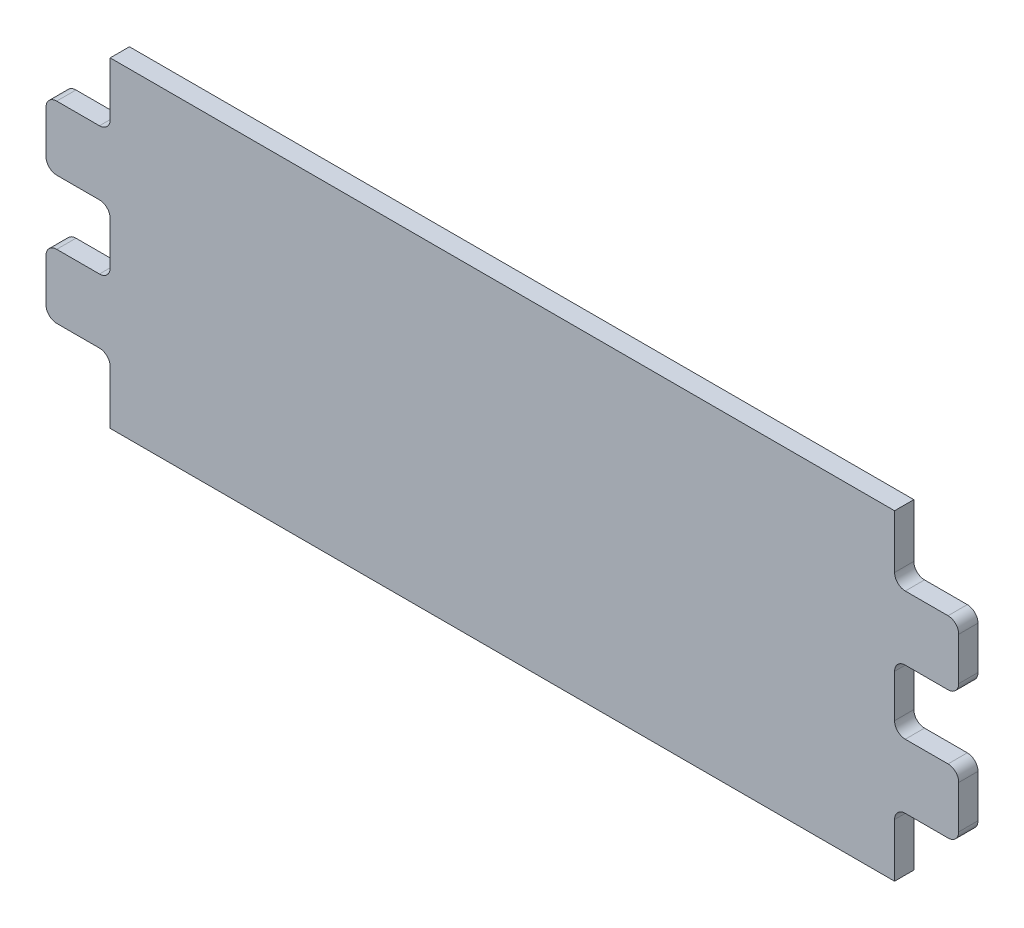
ISO-10303-21;
HEADER;
FILE_DESCRIPTION(('STEP AP214'),'2;1');
FILE_NAME('part.step','',(''),(''),'','','');
FILE_SCHEMA(('AUTOMOTIVE_DESIGN { 1 0 10303 214 1 1 1 1 }'));
ENDSEC;
DATA;
#1=APPLICATION_CONTEXT('core data for automotive mechanical design processes');
#2=APPLICATION_PROTOCOL_DEFINITION('international standard','automotive_design',2000,#1);
#3=PRODUCT_CONTEXT('',#1,'mechanical');
#4=PRODUCT('Part','Part','',(#3));
#5=PRODUCT_RELATED_PRODUCT_CATEGORY('part','',(#4));
#6=PRODUCT_DEFINITION_FORMATION('','',#4);
#7=PRODUCT_DEFINITION_CONTEXT('part definition',#1,'design');
#8=PRODUCT_DEFINITION('design','',#6,#7);
#9=PRODUCT_DEFINITION_SHAPE('','',#8);
#10=(LENGTH_UNIT() NAMED_UNIT(*) SI_UNIT(.MILLI.,.METRE.));
#11=(NAMED_UNIT(*) PLANE_ANGLE_UNIT() SI_UNIT($,.RADIAN.));
#12=(NAMED_UNIT(*) SI_UNIT($,.STERADIAN.) SOLID_ANGLE_UNIT());
#13=UNCERTAINTY_MEASURE_WITH_UNIT(LENGTH_MEASURE(1.E-05),#10,'distance_accuracy_value','');
#14=(GEOMETRIC_REPRESENTATION_CONTEXT(3) GLOBAL_UNCERTAINTY_ASSIGNED_CONTEXT((#13)) GLOBAL_UNIT_ASSIGNED_CONTEXT((#10,
#11,#12)) REPRESENTATION_CONTEXT('',''));
#15=CARTESIAN_POINT('',(0.,0.,0.));
#16=DIRECTION('',(0.,0.,1.));
#17=DIRECTION('',(1.,0.,0.));
#18=AXIS2_PLACEMENT_3D('',#15,#16,#17);
#19=CARTESIAN_POINT('',(-389.784653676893,-148.12132034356,9.));
#20=DIRECTION('',(0.,0.,-1.));
#21=DIRECTION('',(-1.,0.,0.));
#22=AXIS2_PLACEMENT_3D('',#19,#20,#21);
#23=PLANE('',#22);
#24=CARTESIAN_POINT('',(-389.784653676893,-148.12132034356,9.));
#25=DIRECTION('',(0.,0.,-1.));
#26=DIRECTION('',(-1.,0.,0.));
#27=AXIS2_PLACEMENT_3D('',#24,#25,#26);
#28=CIRCLE('',#27,2.99999999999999);
#29=CARTESIAN_POINT('',(-391.905974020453,-146.,9.));
#30=VERTEX_POINT('',#29);
#31=CARTESIAN_POINT('',(-387.663333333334,-150.242640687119,9.));
#32=VERTEX_POINT('',#31);
#33=EDGE_CURVE('E950',#30,#32,#28,.T.);
#34=ORIENTED_EDGE('',*,*,#33,.T.);
#35=DIRECTION('',(0.,-1.,0.));
#36=VECTOR('',#35,1.);
#37=CARTESIAN_POINT('',(-387.663333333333,-169.75735931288,9.));
#38=LINE('',#37,#36);
#39=CARTESIAN_POINT('',(-387.663333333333,-169.75735931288,9.));
#40=VERTEX_POINT('',#39);
#41=EDGE_CURVE('E11',#32,#40,#38,.T.);
#42=ORIENTED_EDGE('',*,*,#41,.T.);
#43=CARTESIAN_POINT('',(-389.784653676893,-171.87867965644,9.));
#44=DIRECTION('',(0.,0.,-1.));
#45=DIRECTION('',(1.,0.,0.));
#46=AXIS2_PLACEMENT_3D('',#43,#44,#45);
#47=CIRCLE('',#46,3.);
#48=CARTESIAN_POINT('',(-391.905974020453,-173.999999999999,9.));
#49=VERTEX_POINT('',#48);
#50=EDGE_CURVE('E48',#40,#49,#47,.T.);
#51=ORIENTED_EDGE('',*,*,#50,.T.);
#52=DIRECTION('',(-1.,0.,0.));
#53=VECTOR('',#52,1.);
#54=CARTESIAN_POINT('',(-391.905974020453,-173.999999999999,9.));
#55=LINE('',#54,#53);
#56=CARTESIAN_POINT('',(-401.420692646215,-173.999999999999,9.));
#57=VERTEX_POINT('',#56);
#58=EDGE_CURVE('E56',#49,#57,#55,.T.);
#59=ORIENTED_EDGE('',*,*,#58,.T.);
#60=CARTESIAN_POINT('',(-403.542012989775,-171.87867965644,9.));
#61=DIRECTION('',(0.,0.,-1.));
#62=DIRECTION('',(-1.,0.,0.));
#63=AXIS2_PLACEMENT_3D('',#60,#61,#62);
#64=CIRCLE('',#63,3.);
#65=CARTESIAN_POINT('',(-405.663333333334,-169.75735931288,9.));
#66=VERTEX_POINT('',#65);
#67=EDGE_CURVE('E974',#57,#66,#64,.T.);
#68=ORIENTED_EDGE('',*,*,#67,.T.);
#69=DIRECTION('',(0.,1.,0.));
#70=VECTOR('',#69,1.);
#71=CARTESIAN_POINT('',(-405.663333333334,-169.75735931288,9.));
#72=LINE('',#71,#70);
#73=CARTESIAN_POINT('',(-405.663333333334,-150.242640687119,9.));
#74=VERTEX_POINT('',#73);
#75=EDGE_CURVE('E968',#66,#74,#72,.T.);
#76=ORIENTED_EDGE('',*,*,#75,.T.);
#77=CARTESIAN_POINT('',(-403.542012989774,-148.12132034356,9.));
#78=DIRECTION('',(0.,0.,-1.));
#79=DIRECTION('',(1.,0.,0.));
#80=AXIS2_PLACEMENT_3D('',#77,#78,#79);
#81=CIRCLE('',#80,2.99999999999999);
#82=CARTESIAN_POINT('',(-401.420692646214,-146.,9.));
#83=VERTEX_POINT('',#82);
#84=EDGE_CURVE('E962',#74,#83,#81,.T.);
#85=ORIENTED_EDGE('',*,*,#84,.T.);
#86=DIRECTION('',(1.,0.,0.));
#87=VECTOR('',#86,1.);
#88=CARTESIAN_POINT('',(-391.905974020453,-146.,9.));
#89=LINE('',#88,#87);
#90=EDGE_CURVE('E956',#83,#30,#89,.T.);
#91=ORIENTED_EDGE('',*,*,#90,.T.);
#92=EDGE_LOOP('',(#34,#42,#51,#59,#68,#76,#85,#91));
#93=FACE_BOUND('',#92,.T.);
#94=ADVANCED_FACE('F34',(#93),#23,.T.);
#95=CARTESIAN_POINT('',(-387.663333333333,-169.75735931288,9.));
#96=DIRECTION('',(1.,0.,0.));
#97=DIRECTION('',(0.,1.,0.));
#98=AXIS2_PLACEMENT_3D('',#95,#96,#97);
#99=PLANE('',#98);
#100=DIRECTION('',(0.,-1.,0.));
#101=VECTOR('',#100,1.);
#102=CARTESIAN_POINT('',(-387.663333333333,-169.75735931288,0.));
#103=LINE('',#102,#101);
#104=CARTESIAN_POINT('',(-387.663333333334,-150.242640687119,0.));
#105=VERTEX_POINT('',#104);
#106=CARTESIAN_POINT('',(-387.663333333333,-169.75735931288,0.));
#107=VERTEX_POINT('',#106);
#108=EDGE_CURVE('E944',#105,#107,#103,.T.);
#109=ORIENTED_EDGE('',*,*,#108,.T.);
#110=DIRECTION('',(0.,0.,-1.));
#111=VECTOR('',#110,1.);
#112=CARTESIAN_POINT('',(-387.663333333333,-169.75735931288,9.));
#113=LINE('',#112,#111);
#114=EDGE_CURVE('E41',#40,#107,#113,.T.);
#115=ORIENTED_EDGE('',*,*,#114,.F.);
#116=ORIENTED_EDGE('',*,*,#41,.F.);
#117=DIRECTION('',(0.,0.,-1.));
#118=VECTOR('',#117,1.);
#119=CARTESIAN_POINT('',(-387.663333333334,-150.242640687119,9.));
#120=LINE('',#119,#118);
#121=EDGE_CURVE('E947',#32,#105,#120,.T.);
#122=ORIENTED_EDGE('',*,*,#121,.T.);
#123=EDGE_LOOP('',(#109,#115,#116,#122));
#124=FACE_BOUND('',#123,.T.);
#125=ADVANCED_FACE('F986',(#124),#99,.F.);
#126=CARTESIAN_POINT('',(-389.784653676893,-171.87867965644,9.));
#127=DIRECTION('',(0.,0.,-1.));
#128=DIRECTION('',(-1.,0.,0.));
#129=AXIS2_PLACEMENT_3D('',#126,#127,#128);
#130=CYLINDRICAL_SURFACE('',#129,3.);
#131=CARTESIAN_POINT('',(-389.784653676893,-171.87867965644,0.));
#132=DIRECTION('',(0.,0.,-1.));
#133=DIRECTION('',(1.,0.,0.));
#134=AXIS2_PLACEMENT_3D('',#131,#132,#133);
#135=CIRCLE('',#134,3.);
#136=CARTESIAN_POINT('',(-391.905974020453,-173.999999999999,0.));
#137=VERTEX_POINT('',#136);
#138=EDGE_CURVE('E941',#107,#137,#135,.T.);
#139=ORIENTED_EDGE('',*,*,#138,.T.);
#140=DIRECTION('',(0.,0.,-1.));
#141=VECTOR('',#140,1.);
#142=CARTESIAN_POINT('',(-391.905974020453,-173.999999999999,9.));
#143=LINE('',#142,#141);
#144=EDGE_CURVE('E981',#49,#137,#143,.T.);
#145=ORIENTED_EDGE('',*,*,#144,.F.);
#146=ORIENTED_EDGE('',*,*,#50,.F.);
#147=ORIENTED_EDGE('',*,*,#114,.T.);
#148=EDGE_LOOP('',(#139,#145,#146,#147));
#149=FACE_BOUND('',#148,.T.);
#150=ADVANCED_FACE('F983',(#149),#130,.F.);
#151=CARTESIAN_POINT('',(-391.905974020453,-173.999999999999,9.));
#152=DIRECTION('',(0.,-1.,0.));
#153=DIRECTION('',(0.,0.,-1.));
#154=AXIS2_PLACEMENT_3D('',#151,#152,#153);
#155=PLANE('',#154);
#156=DIRECTION('',(-1.,0.,0.));
#157=VECTOR('',#156,1.);
#158=CARTESIAN_POINT('',(-391.905974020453,-173.999999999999,0.));
#159=LINE('',#158,#157);
#160=CARTESIAN_POINT('',(-401.420692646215,-173.999999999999,0.));
#161=VERTEX_POINT('',#160);
#162=EDGE_CURVE('E938',#137,#161,#159,.T.);
#163=ORIENTED_EDGE('',*,*,#162,.T.);
#164=DIRECTION('',(0.,0.,-1.));
#165=VECTOR('',#164,1.);
#166=CARTESIAN_POINT('',(-401.420692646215,-173.999999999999,9.));
#167=LINE('',#166,#165);
#168=EDGE_CURVE('E977',#57,#161,#167,.T.);
#169=ORIENTED_EDGE('',*,*,#168,.F.);
#170=ORIENTED_EDGE('',*,*,#58,.F.);
#171=ORIENTED_EDGE('',*,*,#144,.T.);
#172=EDGE_LOOP('',(#163,#169,#170,#171));
#173=FACE_BOUND('',#172,.T.);
#174=ADVANCED_FACE('F1005',(#173),#155,.F.);
#175=CARTESIAN_POINT('',(-403.542012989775,-171.87867965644,9.));
#176=DIRECTION('',(0.,0.,-1.));
#177=DIRECTION('',(-1.,0.,0.));
#178=AXIS2_PLACEMENT_3D('',#175,#176,#177);
#179=CYLINDRICAL_SURFACE('',#178,3.);
#180=CARTESIAN_POINT('',(-403.542012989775,-171.87867965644,0.));
#181=DIRECTION('',(0.,0.,-1.));
#182=DIRECTION('',(-1.,0.,0.));
#183=AXIS2_PLACEMENT_3D('',#180,#181,#182);
#184=CIRCLE('',#183,3.);
#185=CARTESIAN_POINT('',(-405.663333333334,-169.75735931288,0.));
#186=VERTEX_POINT('',#185);
#187=EDGE_CURVE('E935',#161,#186,#184,.T.);
#188=ORIENTED_EDGE('',*,*,#187,.T.);
#189=DIRECTION('',(0.,0.,-1.));
#190=VECTOR('',#189,1.);
#191=CARTESIAN_POINT('',(-405.663333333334,-169.75735931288,9.));
#192=LINE('',#191,#190);
#193=EDGE_CURVE('E971',#66,#186,#192,.T.);
#194=ORIENTED_EDGE('',*,*,#193,.F.);
#195=ORIENTED_EDGE('',*,*,#67,.F.);
#196=ORIENTED_EDGE('',*,*,#168,.T.);
#197=EDGE_LOOP('',(#188,#194,#195,#196));
#198=FACE_BOUND('',#197,.T.);
#199=ADVANCED_FACE('F1004',(#198),#179,.F.);
#200=CARTESIAN_POINT('',(-405.663333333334,-169.75735931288,9.));
#201=DIRECTION('',(-1.,0.,0.));
#202=DIRECTION('',(0.,-1.,0.));
#203=AXIS2_PLACEMENT_3D('',#200,#201,#202);
#204=PLANE('',#203);
#205=DIRECTION('',(0.,1.,0.));
#206=VECTOR('',#205,1.);
#207=CARTESIAN_POINT('',(-405.663333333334,-169.75735931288,0.));
#208=LINE('',#207,#206);
#209=CARTESIAN_POINT('',(-405.663333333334,-150.242640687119,0.));
#210=VERTEX_POINT('',#209);
#211=EDGE_CURVE('E932',#186,#210,#208,.T.);
#212=ORIENTED_EDGE('',*,*,#211,.T.);
#213=DIRECTION('',(0.,0.,-1.));
#214=VECTOR('',#213,1.);
#215=CARTESIAN_POINT('',(-405.663333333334,-150.242640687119,9.));
#216=LINE('',#215,#214);
#217=EDGE_CURVE('E965',#74,#210,#216,.T.);
#218=ORIENTED_EDGE('',*,*,#217,.F.);
#219=ORIENTED_EDGE('',*,*,#75,.F.);
#220=ORIENTED_EDGE('',*,*,#193,.T.);
#221=EDGE_LOOP('',(#212,#218,#219,#220));
#222=FACE_BOUND('',#221,.T.);
#223=ADVANCED_FACE('F1001',(#222),#204,.F.);
#224=CARTESIAN_POINT('',(-403.542012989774,-148.12132034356,9.));
#225=DIRECTION('',(0.,0.,-1.));
#226=DIRECTION('',(-1.,0.,0.));
#227=AXIS2_PLACEMENT_3D('',#224,#225,#226);
#228=CYLINDRICAL_SURFACE('',#227,2.99999999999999);
#229=CARTESIAN_POINT('',(-403.542012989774,-148.12132034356,0.));
#230=DIRECTION('',(0.,0.,-1.));
#231=DIRECTION('',(1.,0.,0.));
#232=AXIS2_PLACEMENT_3D('',#229,#230,#231);
#233=CIRCLE('',#232,2.99999999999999);
#234=CARTESIAN_POINT('',(-401.420692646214,-146.,0.));
#235=VERTEX_POINT('',#234);
#236=EDGE_CURVE('E929',#210,#235,#233,.T.);
#237=ORIENTED_EDGE('',*,*,#236,.T.);
#238=DIRECTION('',(0.,0.,-1.));
#239=VECTOR('',#238,1.);
#240=CARTESIAN_POINT('',(-401.420692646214,-146.,9.));
#241=LINE('',#240,#239);
#242=EDGE_CURVE('E959',#83,#235,#241,.T.);
#243=ORIENTED_EDGE('',*,*,#242,.F.);
#244=ORIENTED_EDGE('',*,*,#84,.F.);
#245=ORIENTED_EDGE('',*,*,#217,.T.);
#246=EDGE_LOOP('',(#237,#243,#244,#245));
#247=FACE_BOUND('',#246,.T.);
#248=ADVANCED_FACE('F998',(#247),#228,.F.);
#249=CARTESIAN_POINT('',(-391.905974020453,-146.,9.));
#250=DIRECTION('',(0.,1.,0.));
#251=DIRECTION('',(0.,0.,1.));
#252=AXIS2_PLACEMENT_3D('',#249,#250,#251);
#253=PLANE('',#252);
#254=DIRECTION('',(1.,0.,0.));
#255=VECTOR('',#254,1.);
#256=CARTESIAN_POINT('',(-391.905974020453,-146.,0.));
#257=LINE('',#256,#255);
#258=CARTESIAN_POINT('',(-391.905974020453,-146.,0.));
#259=VERTEX_POINT('',#258);
#260=EDGE_CURVE('E926',#235,#259,#257,.T.);
#261=ORIENTED_EDGE('',*,*,#260,.T.);
#262=DIRECTION('',(0.,0.,-1.));
#263=VECTOR('',#262,1.);
#264=CARTESIAN_POINT('',(-391.905974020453,-146.,9.));
#265=LINE('',#264,#263);
#266=EDGE_CURVE('E953',#30,#259,#265,.T.);
#267=ORIENTED_EDGE('',*,*,#266,.F.);
#268=ORIENTED_EDGE('',*,*,#90,.F.);
#269=ORIENTED_EDGE('',*,*,#242,.T.);
#270=EDGE_LOOP('',(#261,#267,#268,#269));
#271=FACE_BOUND('',#270,.T.);
#272=ADVANCED_FACE('F993',(#271),#253,.F.);
#273=CARTESIAN_POINT('',(-389.784653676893,-148.12132034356,9.));
#274=DIRECTION('',(0.,0.,-1.));
#275=DIRECTION('',(-1.,0.,0.));
#276=AXIS2_PLACEMENT_3D('',#273,#274,#275);
#277=CYLINDRICAL_SURFACE('',#276,2.99999999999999);
#278=CARTESIAN_POINT('',(-389.784653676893,-148.12132034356,0.));
#279=DIRECTION('',(0.,0.,-1.));
#280=DIRECTION('',(-1.,0.,0.));
#281=AXIS2_PLACEMENT_3D('',#278,#279,#280);
#282=CIRCLE('',#281,2.99999999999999);
#283=EDGE_CURVE('E924',#259,#105,#282,.T.);
#284=ORIENTED_EDGE('',*,*,#283,.T.);
#285=ORIENTED_EDGE('',*,*,#121,.F.);
#286=ORIENTED_EDGE('',*,*,#33,.F.);
#287=ORIENTED_EDGE('',*,*,#266,.T.);
#288=EDGE_LOOP('',(#284,#285,#286,#287));
#289=FACE_BOUND('',#288,.T.);
#290=ADVANCED_FACE('F991',(#289),#277,.F.);
#291=CARTESIAN_POINT('',(403.545346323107,-148.12132034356,9.));
#292=DIRECTION('',(0.,0.,-1.));
#293=DIRECTION('',(-1.,0.,0.));
#294=AXIS2_PLACEMENT_3D('',#291,#292,#293);
#295=PLANE('',#294);
#296=CARTESIAN_POINT('',(403.545346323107,-148.12132034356,9.));
#297=DIRECTION('',(0.,0.,-1.));
#298=DIRECTION('',(-1.,0.,0.));
#299=AXIS2_PLACEMENT_3D('',#296,#297,#298);
#300=CIRCLE('',#299,2.99999999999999);
#301=CARTESIAN_POINT('',(401.424025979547,-146.,9.));
#302=VERTEX_POINT('',#301);
#303=CARTESIAN_POINT('',(405.666666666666,-150.242640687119,9.));
#304=VERTEX_POINT('',#303);
#305=EDGE_CURVE('E879',#302,#304,#300,.T.);
#306=ORIENTED_EDGE('',*,*,#305,.T.);
#307=DIRECTION('',(0.,-1.,0.));
#308=VECTOR('',#307,1.);
#309=CARTESIAN_POINT('',(405.666666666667,-169.75735931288,9.));
#310=LINE('',#309,#308);
#311=CARTESIAN_POINT('',(405.666666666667,-169.75735931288,9.));
#312=VERTEX_POINT('',#311);
#313=EDGE_CURVE('E921',#304,#312,#310,.T.);
#314=ORIENTED_EDGE('',*,*,#313,.T.);
#315=CARTESIAN_POINT('',(403.545346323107,-171.87867965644,9.));
#316=DIRECTION('',(0.,0.,-1.));
#317=DIRECTION('',(1.,0.,0.));
#318=AXIS2_PLACEMENT_3D('',#315,#316,#317);
#319=CIRCLE('',#318,3.);
#320=CARTESIAN_POINT('',(401.424025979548,-173.999999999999,9.));
#321=VERTEX_POINT('',#320);
#322=EDGE_CURVE('E915',#312,#321,#319,.T.);
#323=ORIENTED_EDGE('',*,*,#322,.T.);
#324=DIRECTION('',(-1.,0.,0.));
#325=VECTOR('',#324,1.);
#326=CARTESIAN_POINT('',(401.424025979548,-173.999999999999,9.));
#327=LINE('',#326,#325);
#328=CARTESIAN_POINT('',(391.909307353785,-173.999999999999,9.));
#329=VERTEX_POINT('',#328);
#330=EDGE_CURVE('E909',#321,#329,#327,.T.);
#331=ORIENTED_EDGE('',*,*,#330,.T.);
#332=CARTESIAN_POINT('',(389.787987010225,-171.87867965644,9.));
#333=DIRECTION('',(0.,0.,-1.));
#334=DIRECTION('',(-1.,0.,0.));
#335=AXIS2_PLACEMENT_3D('',#332,#333,#334);
#336=CIRCLE('',#335,3.);
#337=CARTESIAN_POINT('',(387.666666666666,-169.75735931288,9.));
#338=VERTEX_POINT('',#337);
#339=EDGE_CURVE('E903',#329,#338,#336,.T.);
#340=ORIENTED_EDGE('',*,*,#339,.T.);
#341=DIRECTION('',(0.,1.,0.));
#342=VECTOR('',#341,1.);
#343=CARTESIAN_POINT('',(387.666666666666,-169.75735931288,9.));
#344=LINE('',#343,#342);
#345=CARTESIAN_POINT('',(387.666666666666,-150.242640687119,9.));
#346=VERTEX_POINT('',#345);
#347=EDGE_CURVE('E897',#338,#346,#344,.T.);
#348=ORIENTED_EDGE('',*,*,#347,.T.);
#349=CARTESIAN_POINT('',(389.787987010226,-148.12132034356,9.));
#350=DIRECTION('',(0.,0.,-1.));
#351=DIRECTION('',(1.,0.,0.));
#352=AXIS2_PLACEMENT_3D('',#349,#350,#351);
#353=CIRCLE('',#352,2.99999999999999);
#354=CARTESIAN_POINT('',(391.909307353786,-146.,9.));
#355=VERTEX_POINT('',#354);
#356=EDGE_CURVE('E891',#346,#355,#353,.T.);
#357=ORIENTED_EDGE('',*,*,#356,.T.);
#358=DIRECTION('',(1.,0.,0.));
#359=VECTOR('',#358,1.);
#360=CARTESIAN_POINT('',(401.424025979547,-146.,9.));
#361=LINE('',#360,#359);
#362=EDGE_CURVE('E885',#355,#302,#361,.T.);
#363=ORIENTED_EDGE('',*,*,#362,.T.);
#364=EDGE_LOOP('',(#306,#314,#323,#331,#340,#348,#357,#363));
#365=FACE_BOUND('',#364,.T.);
#366=ADVANCED_FACE('F1068',(#365),#295,.T.);
#367=CARTESIAN_POINT('',(405.666666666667,-169.75735931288,9.));
#368=DIRECTION('',(1.,0.,0.));
#369=DIRECTION('',(0.,1.,0.));
#370=AXIS2_PLACEMENT_3D('',#367,#368,#369);
#371=PLANE('',#370);
#372=DIRECTION('',(0.,-1.,0.));
#373=VECTOR('',#372,1.);
#374=CARTESIAN_POINT('',(405.666666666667,-169.75735931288,0.));
#375=LINE('',#374,#373);
#376=CARTESIAN_POINT('',(405.666666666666,-150.242640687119,0.));
#377=VERTEX_POINT('',#376);
#378=CARTESIAN_POINT('',(405.666666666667,-169.75735931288,0.));
#379=VERTEX_POINT('',#378);
#380=EDGE_CURVE('E873',#377,#379,#375,.T.);
#381=ORIENTED_EDGE('',*,*,#380,.T.);
#382=DIRECTION('',(0.,0.,-1.));
#383=VECTOR('',#382,1.);
#384=CARTESIAN_POINT('',(405.666666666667,-169.75735931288,9.));
#385=LINE('',#384,#383);
#386=EDGE_CURVE('E918',#312,#379,#385,.T.);
#387=ORIENTED_EDGE('',*,*,#386,.F.);
#388=ORIENTED_EDGE('',*,*,#313,.F.);
#389=DIRECTION('',(0.,0.,-1.));
#390=VECTOR('',#389,1.);
#391=CARTESIAN_POINT('',(405.666666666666,-150.242640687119,9.));
#392=LINE('',#391,#390);
#393=EDGE_CURVE('E876',#304,#377,#392,.T.);
#394=ORIENTED_EDGE('',*,*,#393,.T.);
#395=EDGE_LOOP('',(#381,#387,#388,#394));
#396=FACE_BOUND('',#395,.T.);
#397=ADVANCED_FACE('F1077',(#396),#371,.F.);
#398=CARTESIAN_POINT('',(403.545346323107,-171.87867965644,9.));
#399=DIRECTION('',(0.,0.,-1.));
#400=DIRECTION('',(-1.,0.,0.));
#401=AXIS2_PLACEMENT_3D('',#398,#399,#400);
#402=CYLINDRICAL_SURFACE('',#401,3.);
#403=CARTESIAN_POINT('',(403.545346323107,-171.87867965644,0.));
#404=DIRECTION('',(0.,0.,-1.));
#405=DIRECTION('',(1.,0.,0.));
#406=AXIS2_PLACEMENT_3D('',#403,#404,#405);
#407=CIRCLE('',#406,3.);
#408=CARTESIAN_POINT('',(401.424025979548,-173.999999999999,0.));
#409=VERTEX_POINT('',#408);
#410=EDGE_CURVE('E870',#379,#409,#407,.T.);
#411=ORIENTED_EDGE('',*,*,#410,.T.);
#412=DIRECTION('',(0.,0.,-1.));
#413=VECTOR('',#412,1.);
#414=CARTESIAN_POINT('',(401.424025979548,-173.999999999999,9.));
#415=LINE('',#414,#413);
#416=EDGE_CURVE('E912',#321,#409,#415,.T.);
#417=ORIENTED_EDGE('',*,*,#416,.F.);
#418=ORIENTED_EDGE('',*,*,#322,.F.);
#419=ORIENTED_EDGE('',*,*,#386,.T.);
#420=EDGE_LOOP('',(#411,#417,#418,#419));
#421=FACE_BOUND('',#420,.T.);
#422=ADVANCED_FACE('F1087',(#421),#402,.F.);
#423=CARTESIAN_POINT('',(401.424025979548,-173.999999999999,9.));
#424=DIRECTION('',(0.,-1.,0.));
#425=DIRECTION('',(0.,0.,-1.));
#426=AXIS2_PLACEMENT_3D('',#423,#424,#425);
#427=PLANE('',#426);
#428=DIRECTION('',(-1.,0.,0.));
#429=VECTOR('',#428,1.);
#430=CARTESIAN_POINT('',(401.424025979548,-173.999999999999,0.));
#431=LINE('',#430,#429);
#432=CARTESIAN_POINT('',(391.909307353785,-173.999999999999,0.));
#433=VERTEX_POINT('',#432);
#434=EDGE_CURVE('E867',#409,#433,#431,.T.);
#435=ORIENTED_EDGE('',*,*,#434,.T.);
#436=DIRECTION('',(0.,0.,-1.));
#437=VECTOR('',#436,1.);
#438=CARTESIAN_POINT('',(391.909307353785,-173.999999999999,9.));
#439=LINE('',#438,#437);
#440=EDGE_CURVE('E906',#329,#433,#439,.T.);
#441=ORIENTED_EDGE('',*,*,#440,.F.);
#442=ORIENTED_EDGE('',*,*,#330,.F.);
#443=ORIENTED_EDGE('',*,*,#416,.T.);
#444=EDGE_LOOP('',(#435,#441,#442,#443));
#445=FACE_BOUND('',#444,.T.);
#446=ADVANCED_FACE('F1097',(#445),#427,.F.);
#447=CARTESIAN_POINT('',(389.787987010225,-171.87867965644,9.));
#448=DIRECTION('',(0.,0.,-1.));
#449=DIRECTION('',(-1.,0.,0.));
#450=AXIS2_PLACEMENT_3D('',#447,#448,#449);
#451=CYLINDRICAL_SURFACE('',#450,3.);
#452=CARTESIAN_POINT('',(389.787987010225,-171.87867965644,0.));
#453=DIRECTION('',(0.,0.,-1.));
#454=DIRECTION('',(-1.,0.,0.));
#455=AXIS2_PLACEMENT_3D('',#452,#453,#454);
#456=CIRCLE('',#455,3.);
#457=CARTESIAN_POINT('',(387.666666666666,-169.75735931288,0.));
#458=VERTEX_POINT('',#457);
#459=EDGE_CURVE('E864',#433,#458,#456,.T.);
#460=ORIENTED_EDGE('',*,*,#459,.T.);
#461=DIRECTION('',(0.,0.,-1.));
#462=VECTOR('',#461,1.);
#463=CARTESIAN_POINT('',(387.666666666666,-169.75735931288,9.));
#464=LINE('',#463,#462);
#465=EDGE_CURVE('E900',#338,#458,#464,.T.);
#466=ORIENTED_EDGE('',*,*,#465,.F.);
#467=ORIENTED_EDGE('',*,*,#339,.F.);
#468=ORIENTED_EDGE('',*,*,#440,.T.);
#469=EDGE_LOOP('',(#460,#466,#467,#468));
#470=FACE_BOUND('',#469,.T.);
#471=ADVANCED_FACE('F1107',(#470),#451,.F.);
#472=CARTESIAN_POINT('',(387.666666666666,-169.75735931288,9.));
#473=DIRECTION('',(-1.,0.,0.));
#474=DIRECTION('',(0.,-1.,0.));
#475=AXIS2_PLACEMENT_3D('',#472,#473,#474);
#476=PLANE('',#475);
#477=DIRECTION('',(0.,1.,0.));
#478=VECTOR('',#477,1.);
#479=CARTESIAN_POINT('',(387.666666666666,-169.75735931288,0.));
#480=LINE('',#479,#478);
#481=CARTESIAN_POINT('',(387.666666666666,-150.242640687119,0.));
#482=VERTEX_POINT('',#481);
#483=EDGE_CURVE('E861',#458,#482,#480,.T.);
#484=ORIENTED_EDGE('',*,*,#483,.T.);
#485=DIRECTION('',(0.,0.,-1.));
#486=VECTOR('',#485,1.);
#487=CARTESIAN_POINT('',(387.666666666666,-150.242640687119,9.));
#488=LINE('',#487,#486);
#489=EDGE_CURVE('E894',#346,#482,#488,.T.);
#490=ORIENTED_EDGE('',*,*,#489,.F.);
#491=ORIENTED_EDGE('',*,*,#347,.F.);
#492=ORIENTED_EDGE('',*,*,#465,.T.);
#493=EDGE_LOOP('',(#484,#490,#491,#492));
#494=FACE_BOUND('',#493,.T.);
#495=ADVANCED_FACE('F1117',(#494),#476,.F.);
#496=CARTESIAN_POINT('',(389.787987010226,-148.12132034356,9.));
#497=DIRECTION('',(0.,0.,-1.));
#498=DIRECTION('',(-1.,0.,0.));
#499=AXIS2_PLACEMENT_3D('',#496,#497,#498);
#500=CYLINDRICAL_SURFACE('',#499,2.99999999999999);
#501=CARTESIAN_POINT('',(389.787987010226,-148.12132034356,0.));
#502=DIRECTION('',(0.,0.,-1.));
#503=DIRECTION('',(1.,0.,0.));
#504=AXIS2_PLACEMENT_3D('',#501,#502,#503);
#505=CIRCLE('',#504,2.99999999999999);
#506=CARTESIAN_POINT('',(391.909307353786,-146.,0.));
#507=VERTEX_POINT('',#506);
#508=EDGE_CURVE('E858',#482,#507,#505,.T.);
#509=ORIENTED_EDGE('',*,*,#508,.T.);
#510=DIRECTION('',(0.,0.,-1.));
#511=VECTOR('',#510,1.);
#512=CARTESIAN_POINT('',(391.909307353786,-146.,9.));
#513=LINE('',#512,#511);
#514=EDGE_CURVE('E888',#355,#507,#513,.T.);
#515=ORIENTED_EDGE('',*,*,#514,.F.);
#516=ORIENTED_EDGE('',*,*,#356,.F.);
#517=ORIENTED_EDGE('',*,*,#489,.T.);
#518=EDGE_LOOP('',(#509,#515,#516,#517));
#519=FACE_BOUND('',#518,.T.);
#520=ADVANCED_FACE('F1127',(#519),#500,.F.);
#521=CARTESIAN_POINT('',(401.424025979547,-146.,9.));
#522=DIRECTION('',(0.,1.,0.));
#523=DIRECTION('',(0.,0.,1.));
#524=AXIS2_PLACEMENT_3D('',#521,#522,#523);
#525=PLANE('',#524);
#526=DIRECTION('',(1.,0.,0.));
#527=VECTOR('',#526,1.);
#528=CARTESIAN_POINT('',(401.424025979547,-146.,0.));
#529=LINE('',#528,#527);
#530=CARTESIAN_POINT('',(401.424025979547,-146.,0.));
#531=VERTEX_POINT('',#530);
#532=EDGE_CURVE('E855',#507,#531,#529,.T.);
#533=ORIENTED_EDGE('',*,*,#532,.T.);
#534=DIRECTION('',(0.,0.,-1.));
#535=VECTOR('',#534,1.);
#536=CARTESIAN_POINT('',(401.424025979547,-146.,9.));
#537=LINE('',#536,#535);
#538=EDGE_CURVE('E882',#302,#531,#537,.T.);
#539=ORIENTED_EDGE('',*,*,#538,.F.);
#540=ORIENTED_EDGE('',*,*,#362,.F.);
#541=ORIENTED_EDGE('',*,*,#514,.T.);
#542=EDGE_LOOP('',(#533,#539,#540,#541));
#543=FACE_BOUND('',#542,.T.);
#544=ADVANCED_FACE('F1137',(#543),#525,.F.);
#545=CARTESIAN_POINT('',(403.545346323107,-148.12132034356,9.));
#546=DIRECTION('',(0.,0.,-1.));
#547=DIRECTION('',(-1.,0.,0.));
#548=AXIS2_PLACEMENT_3D('',#545,#546,#547);
#549=CYLINDRICAL_SURFACE('',#548,2.99999999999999);
#550=CARTESIAN_POINT('',(403.545346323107,-148.12132034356,0.));
#551=DIRECTION('',(0.,0.,-1.));
#552=DIRECTION('',(-1.,0.,0.));
#553=AXIS2_PLACEMENT_3D('',#550,#551,#552);
#554=CIRCLE('',#553,2.99999999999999);
#555=EDGE_CURVE('E853',#531,#377,#554,.T.);
#556=ORIENTED_EDGE('',*,*,#555,.T.);
#557=ORIENTED_EDGE('',*,*,#393,.F.);
#558=ORIENTED_EDGE('',*,*,#305,.F.);
#559=ORIENTED_EDGE('',*,*,#538,.T.);
#560=EDGE_LOOP('',(#556,#557,#558,#559));
#561=FACE_BOUND('',#560,.T.);
#562=ADVANCED_FACE('F1147',(#561),#549,.F.);
#563=CARTESIAN_POINT('',(850.,-1.11022302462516E-13,18.));
#564=DIRECTION('',(0.,0.,1.));
#565=DIRECTION('',(1.,0.,0.));
#566=AXIS2_PLACEMENT_3D('',#563,#564,#565);
#567=PLANE('',#566);
#568=DIRECTION('',(1.,0.,0.));
#569=VECTOR('',#568,1.);
#570=CARTESIAN_POINT('',(850.,-9.99999999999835,18.));
#571=LINE('',#570,#569);
#572=CARTESIAN_POINT('',(-416.666666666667,-10.0000000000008,18.));
#573=VERTEX_POINT('',#572);
#574=CARTESIAN_POINT('',(-376.666666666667,-10.0000000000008,18.));
#575=VERTEX_POINT('',#574);
#576=EDGE_CURVE('E669',#573,#575,#571,.T.);
#577=ORIENTED_EDGE('',*,*,#576,.F.);
#578=CARTESIAN_POINT('',(-416.666666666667,-20.0000000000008,18.));
#579=DIRECTION('',(0.,0.,1.));
#580=DIRECTION('',(1.,0.,0.));
#581=AXIS2_PLACEMENT_3D('',#578,#579,#580);
#582=CIRCLE('',#581,10.);
#583=CARTESIAN_POINT('',(-426.666666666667,-20.0000000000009,18.));
#584=VERTEX_POINT('',#583);
#585=EDGE_CURVE('E771',#573,#584,#582,.T.);
#586=ORIENTED_EDGE('',*,*,#585,.T.);
#587=DIRECTION('',(0.,1.,0.));
#588=VECTOR('',#587,1.);
#589=CARTESIAN_POINT('',(-426.666666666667,-2.47333018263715E-12,18.));
#590=LINE('',#589,#588);
#591=CARTESIAN_POINT('',(-426.666666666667,-60.0000000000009,18.));
#592=VERTEX_POINT('',#591);
#593=EDGE_CURVE('E672',#592,#584,#590,.T.);
#594=ORIENTED_EDGE('',*,*,#593,.F.);
#595=CARTESIAN_POINT('',(-416.666666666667,-60.0000000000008,18.));
#596=DIRECTION('',(0.,0.,1.));
#597=DIRECTION('',(1.,0.,0.));
#598=AXIS2_PLACEMENT_3D('',#595,#596,#597);
#599=CIRCLE('',#598,10.);
#600=CARTESIAN_POINT('',(-416.666666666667,-70.0000000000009,18.));
#601=VERTEX_POINT('',#600);
#602=EDGE_CURVE('E769',#592,#601,#599,.T.);
#603=ORIENTED_EDGE('',*,*,#602,.T.);
#604=DIRECTION('',(-1.,0.,0.));
#605=VECTOR('',#604,1.);
#606=CARTESIAN_POINT('',(850.,-69.9999999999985,18.));
#607=LINE('',#606,#605);
#608=CARTESIAN_POINT('',(-376.666666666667,-70.0000000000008,18.));
#609=VERTEX_POINT('',#608);
#610=EDGE_CURVE('E675',#609,#601,#607,.T.);
#611=ORIENTED_EDGE('',*,*,#610,.F.);
#612=CARTESIAN_POINT('',(-376.666666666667,-80.0000000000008,18.));
#613=DIRECTION('',(0.,0.,1.));
#614=DIRECTION('',(1.,0.,0.));
#615=AXIS2_PLACEMENT_3D('',#612,#613,#614);
#616=CIRCLE('',#615,10.);
#617=CARTESIAN_POINT('',(-366.666666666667,-80.0000000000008,18.));
#618=VERTEX_POINT('',#617);
#619=EDGE_CURVE('E827',#609,#618,#616,.F.);
#620=ORIENTED_EDGE('',*,*,#619,.T.);
#621=DIRECTION('',(0.,1.,0.));
#622=VECTOR('',#621,1.);
#623=CARTESIAN_POINT('',(-366.666666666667,-2.36230788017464E-12,18.));
#624=LINE('',#623,#622);
#625=CARTESIAN_POINT('',(-366.666666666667,-120.000000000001,18.));
#626=VERTEX_POINT('',#625);
#627=EDGE_CURVE('E678',#626,#618,#624,.T.);
#628=ORIENTED_EDGE('',*,*,#627,.F.);
#629=CARTESIAN_POINT('',(-376.666666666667,-120.000000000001,18.));
#630=DIRECTION('',(0.,0.,1.));
#631=DIRECTION('',(1.,0.,0.));
#632=AXIS2_PLACEMENT_3D('',#629,#630,#631);
#633=CIRCLE('',#632,10.);
#634=CARTESIAN_POINT('',(-376.666666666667,-130.000000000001,18.));
#635=VERTEX_POINT('',#634);
#636=EDGE_CURVE('E831',#626,#635,#633,.F.);
#637=ORIENTED_EDGE('',*,*,#636,.T.);
#638=DIRECTION('',(1.,0.,0.));
#639=VECTOR('',#638,1.);
#640=CARTESIAN_POINT('',(850.,-129.999999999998,18.));
#641=LINE('',#640,#639);
#642=CARTESIAN_POINT('',(-416.666666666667,-130.000000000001,18.));
#643=VERTEX_POINT('',#642);
#644=EDGE_CURVE('E681',#643,#635,#641,.T.);
#645=ORIENTED_EDGE('',*,*,#644,.F.);
#646=CARTESIAN_POINT('',(-416.666666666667,-140.000000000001,18.));
#647=DIRECTION('',(0.,0.,1.));
#648=DIRECTION('',(1.,0.,0.));
#649=AXIS2_PLACEMENT_3D('',#646,#647,#648);
#650=CIRCLE('',#649,10.);
#651=CARTESIAN_POINT('',(-426.666666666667,-140.000000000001,18.));
#652=VERTEX_POINT('',#651);
#653=EDGE_CURVE('E767',#643,#652,#650,.T.);
#654=ORIENTED_EDGE('',*,*,#653,.T.);
#655=DIRECTION('',(0.,1.,0.));
#656=VECTOR('',#655,1.);
#657=CARTESIAN_POINT('',(-426.666666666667,-2.47333018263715E-12,18.));
#658=LINE('',#657,#656);
#659=CARTESIAN_POINT('',(-426.666666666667,-180.000000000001,18.));
#660=VERTEX_POINT('',#659);
#661=EDGE_CURVE('E684',#660,#652,#658,.T.);
#662=ORIENTED_EDGE('',*,*,#661,.F.);
#663=CARTESIAN_POINT('',(-416.666666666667,-180.000000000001,18.));
#664=DIRECTION('',(0.,0.,1.));
#665=DIRECTION('',(1.,0.,0.));
#666=AXIS2_PLACEMENT_3D('',#663,#664,#665);
#667=CIRCLE('',#666,10.);
#668=CARTESIAN_POINT('',(-416.666666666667,-190.000000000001,18.));
#669=VERTEX_POINT('',#668);
#670=EDGE_CURVE('E765',#660,#669,#667,.T.);
#671=ORIENTED_EDGE('',*,*,#670,.T.);
#672=DIRECTION('',(-1.,0.,0.));
#673=VECTOR('',#672,1.);
#674=CARTESIAN_POINT('',(850.,-189.999999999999,18.));
#675=LINE('',#674,#673);
#676=CARTESIAN_POINT('',(-376.666666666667,-190.000000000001,18.));
#677=VERTEX_POINT('',#676);
#678=EDGE_CURVE('E687',#677,#669,#675,.T.);
#679=ORIENTED_EDGE('',*,*,#678,.F.);
#680=CARTESIAN_POINT('',(-376.666666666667,-200.000000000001,18.));
#681=DIRECTION('',(0.,0.,1.));
#682=DIRECTION('',(1.,0.,0.));
#683=AXIS2_PLACEMENT_3D('',#680,#681,#682);
#684=CIRCLE('',#683,10.);
#685=CARTESIAN_POINT('',(-366.666666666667,-200.000000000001,18.));
#686=VERTEX_POINT('',#685);
#687=EDGE_CURVE('E835',#677,#686,#684,.F.);
#688=ORIENTED_EDGE('',*,*,#687,.T.);
#689=DIRECTION('',(0.,1.,0.));
#690=VECTOR('',#689,1.);
#691=CARTESIAN_POINT('',(-366.666666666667,-2.36230788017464E-12,18.));
#692=LINE('',#691,#690);
#693=CARTESIAN_POINT('',(-366.666666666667,-250.,18.));
#694=VERTEX_POINT('',#693);
#695=EDGE_CURVE('E690',#694,#686,#692,.T.);
#696=ORIENTED_EDGE('',*,*,#695,.F.);
#697=DIRECTION('',(1.,0.,0.));
#698=VECTOR('',#697,1.);
#699=CARTESIAN_POINT('',(-850.000000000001,-250.,18.));
#700=LINE('',#699,#698);
#701=CARTESIAN_POINT('',(366.666666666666,-250.,18.));
#702=VERTEX_POINT('',#701);
#703=EDGE_CURVE('E700',#694,#702,#700,.T.);
#704=ORIENTED_EDGE('',*,*,#703,.T.);
#705=DIRECTION('',(0.,1.,0.));
#706=VECTOR('',#705,1.);
#707=CARTESIAN_POINT('',(366.666666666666,-1.11022302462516E-13,18.));
#708=LINE('',#707,#706);
#709=CARTESIAN_POINT('',(366.666666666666,-200.,18.));
#710=VERTEX_POINT('',#709);
#711=EDGE_CURVE('E647',#702,#710,#708,.T.);
#712=ORIENTED_EDGE('',*,*,#711,.T.);
#713=CARTESIAN_POINT('',(376.666666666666,-200.,18.));
#714=DIRECTION('',(0.,0.,1.));
#715=DIRECTION('',(1.,0.,0.));
#716=AXIS2_PLACEMENT_3D('',#713,#714,#715);
#717=CIRCLE('',#716,10.);
#718=CARTESIAN_POINT('',(376.666666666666,-190.,18.));
#719=VERTEX_POINT('',#718);
#720=EDGE_CURVE('E839',#710,#719,#717,.F.);
#721=ORIENTED_EDGE('',*,*,#720,.T.);
#722=DIRECTION('',(1.,0.,0.));
#723=VECTOR('',#722,1.);
#724=CARTESIAN_POINT('',(850.,-190.,18.));
#725=LINE('',#724,#723);
#726=CARTESIAN_POINT('',(416.666666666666,-190.,18.));
#727=VERTEX_POINT('',#726);
#728=EDGE_CURVE('E650',#719,#727,#725,.T.);
#729=ORIENTED_EDGE('',*,*,#728,.T.);
#730=CARTESIAN_POINT('',(416.666666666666,-180.,18.));
#731=DIRECTION('',(0.,0.,1.));
#732=DIRECTION('',(1.,0.,0.));
#733=AXIS2_PLACEMENT_3D('',#730,#731,#732);
#734=CIRCLE('',#733,10.);
#735=CARTESIAN_POINT('',(426.666666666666,-180.,18.));
#736=VERTEX_POINT('',#735);
#737=EDGE_CURVE('E729',#727,#736,#734,.T.);
#738=ORIENTED_EDGE('',*,*,#737,.T.);
#739=DIRECTION('',(0.,1.,0.));
#740=VECTOR('',#739,1.);
#741=CARTESIAN_POINT('',(426.666666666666,-1.11022302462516E-13,18.));
#742=LINE('',#741,#740);
#743=CARTESIAN_POINT('',(426.666666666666,-140.,18.));
#744=VERTEX_POINT('',#743);
#745=EDGE_CURVE('E652',#736,#744,#742,.T.);
#746=ORIENTED_EDGE('',*,*,#745,.T.);
#747=CARTESIAN_POINT('',(416.666666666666,-140.,18.));
#748=DIRECTION('',(0.,0.,1.));
#749=DIRECTION('',(1.,0.,0.));
#750=AXIS2_PLACEMENT_3D('',#747,#748,#749);
#751=CIRCLE('',#750,10.);
#752=CARTESIAN_POINT('',(416.666666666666,-130.,18.));
#753=VERTEX_POINT('',#752);
#754=EDGE_CURVE('E727',#744,#753,#751,.T.);
#755=ORIENTED_EDGE('',*,*,#754,.T.);
#756=DIRECTION('',(-1.,0.,0.));
#757=VECTOR('',#756,1.);
#758=CARTESIAN_POINT('',(850.,-130.,18.));
#759=LINE('',#758,#757);
#760=CARTESIAN_POINT('',(376.666666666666,-130.,18.));
#761=VERTEX_POINT('',#760);
#762=EDGE_CURVE('E655',#753,#761,#759,.T.);
#763=ORIENTED_EDGE('',*,*,#762,.T.);
#764=CARTESIAN_POINT('',(376.666666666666,-120.,18.));
#765=DIRECTION('',(0.,0.,1.));
#766=DIRECTION('',(1.,0.,0.));
#767=AXIS2_PLACEMENT_3D('',#764,#765,#766);
#768=CIRCLE('',#767,10.);
#769=CARTESIAN_POINT('',(366.666666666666,-120.,18.));
#770=VERTEX_POINT('',#769);
#771=EDGE_CURVE('E843',#761,#770,#768,.F.);
#772=ORIENTED_EDGE('',*,*,#771,.T.);
#773=DIRECTION('',(0.,1.,0.));
#774=VECTOR('',#773,1.);
#775=CARTESIAN_POINT('',(366.666666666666,-1.11022302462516E-13,18.));
#776=LINE('',#775,#774);
#777=CARTESIAN_POINT('',(366.666666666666,-80.0000000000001,18.));
#778=VERTEX_POINT('',#777);
#779=EDGE_CURVE('E658',#770,#778,#776,.T.);
#780=ORIENTED_EDGE('',*,*,#779,.T.);
#781=CARTESIAN_POINT('',(376.666666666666,-80.0000000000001,18.));
#782=DIRECTION('',(0.,0.,1.));
#783=DIRECTION('',(1.,0.,0.));
#784=AXIS2_PLACEMENT_3D('',#781,#782,#783);
#785=CIRCLE('',#784,10.);
#786=CARTESIAN_POINT('',(376.666666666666,-70.0000000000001,18.));
#787=VERTEX_POINT('',#786);
#788=EDGE_CURVE('E847',#778,#787,#785,.F.);
#789=ORIENTED_EDGE('',*,*,#788,.T.);
#790=DIRECTION('',(1.,0.,0.));
#791=VECTOR('',#790,1.);
#792=CARTESIAN_POINT('',(850.,-70.0000000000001,18.));
#793=LINE('',#792,#791);
#794=CARTESIAN_POINT('',(416.666666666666,-70.0000000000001,18.));
#795=VERTEX_POINT('',#794);
#796=EDGE_CURVE('E661',#787,#795,#793,.T.);
#797=ORIENTED_EDGE('',*,*,#796,.T.);
#798=CARTESIAN_POINT('',(416.666666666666,-60.0000000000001,18.));
#799=DIRECTION('',(0.,0.,1.));
#800=DIRECTION('',(1.,0.,0.));
#801=AXIS2_PLACEMENT_3D('',#798,#799,#800);
#802=CIRCLE('',#801,10.);
#803=CARTESIAN_POINT('',(426.666666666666,-60.0000000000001,18.));
#804=VERTEX_POINT('',#803);
#805=EDGE_CURVE('E725',#795,#804,#802,.T.);
#806=ORIENTED_EDGE('',*,*,#805,.T.);
#807=DIRECTION('',(0.,1.,0.));
#808=VECTOR('',#807,1.);
#809=CARTESIAN_POINT('',(426.666666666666,-1.11022302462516E-13,18.));
#810=LINE('',#809,#808);
#811=CARTESIAN_POINT('',(426.666666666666,-20.0000000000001,18.));
#812=VERTEX_POINT('',#811);
#813=EDGE_CURVE('E663',#804,#812,#810,.T.);
#814=ORIENTED_EDGE('',*,*,#813,.T.);
#815=CARTESIAN_POINT('',(416.666666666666,-20.0000000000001,18.));
#816=DIRECTION('',(0.,0.,1.));
#817=DIRECTION('',(1.,0.,0.));
#818=AXIS2_PLACEMENT_3D('',#815,#816,#817);
#819=CIRCLE('',#818,10.);
#820=CARTESIAN_POINT('',(416.666666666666,-10.0000000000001,18.));
#821=VERTEX_POINT('',#820);
#822=EDGE_CURVE('E723',#812,#821,#819,.T.);
#823=ORIENTED_EDGE('',*,*,#822,.T.);
#824=DIRECTION('',(-1.,0.,0.));
#825=VECTOR('',#824,1.);
#826=CARTESIAN_POINT('',(850.,-10.0000000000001,18.));
#827=LINE('',#826,#825);
#828=CARTESIAN_POINT('',(376.666666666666,-10.0000000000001,18.));
#829=VERTEX_POINT('',#828);
#830=EDGE_CURVE('E666',#821,#829,#827,.T.);
#831=ORIENTED_EDGE('',*,*,#830,.T.);
#832=CARTESIAN_POINT('',(376.666666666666,0.,18.));
#833=DIRECTION('',(0.,0.,1.));
#834=DIRECTION('',(1.,0.,0.));
#835=AXIS2_PLACEMENT_3D('',#832,#833,#834);
#836=CIRCLE('',#835,10.);
#837=CARTESIAN_POINT('',(366.666666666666,0.,18.));
#838=VERTEX_POINT('',#837);
#839=EDGE_CURVE('E851',#829,#838,#836,.F.);
#840=ORIENTED_EDGE('',*,*,#839,.T.);
#841=DIRECTION('',(0.,1.,0.));
#842=VECTOR('',#841,1.);
#843=CARTESIAN_POINT('',(366.666666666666,-1.11022302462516E-13,18.));
#844=LINE('',#843,#842);
#845=CARTESIAN_POINT('',(366.666666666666,49.9999999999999,17.9999999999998));
#846=VERTEX_POINT('',#845);
#847=EDGE_CURVE('E615',#838,#846,#844,.T.);
#848=ORIENTED_EDGE('',*,*,#847,.T.);
#849=DIRECTION('',(1.,0.,0.));
#850=VECTOR('',#849,1.);
#851=CARTESIAN_POINT('',(-750.000000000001,49.9999999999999,17.9999999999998));
#852=LINE('',#851,#850);
#853=CARTESIAN_POINT('',(-366.666666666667,49.9999999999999,17.9999999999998));
#854=VERTEX_POINT('',#853);
#855=EDGE_CURVE('E694',#854,#846,#852,.T.);
#856=ORIENTED_EDGE('',*,*,#855,.F.);
#857=DIRECTION('',(0.,1.,0.));
#858=VECTOR('',#857,1.);
#859=CARTESIAN_POINT('',(-366.666666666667,-2.36230788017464E-12,18.));
#860=LINE('',#859,#858);
#861=CARTESIAN_POINT('',(-366.666666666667,-7.44581865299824E-13,18.));
#862=VERTEX_POINT('',#861);
#863=EDGE_CURVE('E645',#862,#854,#860,.T.);
#864=ORIENTED_EDGE('',*,*,#863,.F.);
#865=CARTESIAN_POINT('',(-376.666666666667,-7.6308558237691E-13,18.));
#866=DIRECTION('',(0.,0.,1.));
#867=DIRECTION('',(1.,0.,0.));
#868=AXIS2_PLACEMENT_3D('',#865,#866,#867);
#869=CIRCLE('',#868,10.);
#870=EDGE_CURVE('E823',#862,#575,#869,.F.);
#871=ORIENTED_EDGE('',*,*,#870,.T.);
#872=EDGE_LOOP('',(#577,#586,#594,#603,#611,#620,#628,#637,#645,#654,#662,#671,#679,#688,#696,
#704,#712,#721,#729,#738,#746,#755,#763,#772,#780,#789,#797,#806,#814,#823,#831,#840,#848,#856,
#864,#871));
#873=FACE_BOUND('',#872,.T.);
#874=ADVANCED_FACE('F1157',(#873),#567,.T.);
#875=CARTESIAN_POINT('',(-850.000000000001,-250.,18.));
#876=DIRECTION('',(0.,1.,0.));
#877=DIRECTION('',(0.,0.,1.));
#878=AXIS2_PLACEMENT_3D('',#875,#876,#877);
#879=PLANE('',#878);
#880=ORIENTED_EDGE('',*,*,#703,.F.);
#881=DIRECTION('',(0.,0.,-1.));
#882=VECTOR('',#881,1.);
#883=CARTESIAN_POINT('',(-366.666666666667,-250.,30.));
#884=LINE('',#883,#882);
#885=CARTESIAN_POINT('',(-366.666666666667,-250.,0.));
#886=VERTEX_POINT('',#885);
#887=EDGE_CURVE('E612',#694,#886,#884,.T.);
#888=ORIENTED_EDGE('',*,*,#887,.T.);
#889=DIRECTION('',(1.,0.,0.));
#890=VECTOR('',#889,1.);
#891=CARTESIAN_POINT('',(-850.000000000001,-250.,0.));
#892=LINE('',#891,#890);
#893=CARTESIAN_POINT('',(366.666666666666,-250.,0.));
#894=VERTEX_POINT('',#893);
#895=EDGE_CURVE('E697',#886,#894,#892,.T.);
#896=ORIENTED_EDGE('',*,*,#895,.T.);
#897=DIRECTION('',(0.,0.,-1.));
#898=VECTOR('',#897,1.);
#899=CARTESIAN_POINT('',(366.666666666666,-250.,30.));
#900=LINE('',#899,#898);
#901=EDGE_CURVE('E616',#702,#894,#900,.T.);
#902=ORIENTED_EDGE('',*,*,#901,.F.);
#903=EDGE_LOOP('',(#880,#888,#896,#902));
#904=FACE_BOUND('',#903,.T.);
#905=ADVANCED_FACE('F1169',(#904),#879,.F.);
#906=CARTESIAN_POINT('',(850.,-1.11022302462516E-13,0.));
#907=DIRECTION('',(0.,0.,1.));
#908=DIRECTION('',(1.,0.,0.));
#909=AXIS2_PLACEMENT_3D('',#906,#907,#908);
#910=PLANE('',#909);
#911=DIRECTION('',(0.,-1.,0.));
#912=VECTOR('',#911,1.);
#913=CARTESIAN_POINT('',(-387.663333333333,-49.7573593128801,0.));
#914=LINE('',#913,#912);
#915=CARTESIAN_POINT('',(-387.663333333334,-30.2426406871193,0.));
#916=VERTEX_POINT('',#915);
#917=CARTESIAN_POINT('',(-387.663333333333,-49.7573593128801,0.));
#918=VERTEX_POINT('',#917);
#919=EDGE_CURVE('E471',#916,#918,#914,.T.);
#920=ORIENTED_EDGE('',*,*,#919,.F.);
#921=CARTESIAN_POINT('',(-389.784653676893,-28.1213203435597,0.));
#922=DIRECTION('',(0.,0.,-1.));
#923=DIRECTION('',(-1.,0.,0.));
#924=AXIS2_PLACEMENT_3D('',#921,#922,#923);
#925=CIRCLE('',#924,2.99999999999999);
#926=CARTESIAN_POINT('',(-391.905974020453,-26.0000000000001,0.));
#927=VERTEX_POINT('',#926);
#928=EDGE_CURVE('E485',#927,#916,#925,.T.);
#929=ORIENTED_EDGE('',*,*,#928,.F.);
#930=DIRECTION('',(1.,0.,0.));
#931=VECTOR('',#930,1.);
#932=CARTESIAN_POINT('',(-391.905974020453,-26.0000000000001,0.));
#933=LINE('',#932,#931);
#934=CARTESIAN_POINT('',(-401.420692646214,-26.0000000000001,0.));
#935=VERTEX_POINT('',#934);
#936=EDGE_CURVE('E515',#935,#927,#933,.T.);
#937=ORIENTED_EDGE('',*,*,#936,.F.);
#938=CARTESIAN_POINT('',(-403.542012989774,-28.1213203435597,0.));
#939=DIRECTION('',(0.,0.,-1.));
#940=DIRECTION('',(1.,0.,0.));
#941=AXIS2_PLACEMENT_3D('',#938,#939,#940);
#942=CIRCLE('',#941,2.99999999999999);
#943=CARTESIAN_POINT('',(-405.663333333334,-30.2426406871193,0.));
#944=VERTEX_POINT('',#943);
#945=EDGE_CURVE('E510',#944,#935,#942,.T.);
#946=ORIENTED_EDGE('',*,*,#945,.F.);
#947=DIRECTION('',(0.,1.,0.));
#948=VECTOR('',#947,1.);
#949=CARTESIAN_POINT('',(-405.663333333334,-49.7573593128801,0.));
#950=LINE('',#949,#948);
#951=CARTESIAN_POINT('',(-405.663333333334,-49.7573593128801,0.));
#952=VERTEX_POINT('',#951);
#953=EDGE_CURVE('E505',#952,#944,#950,.T.);
#954=ORIENTED_EDGE('',*,*,#953,.F.);
#955=CARTESIAN_POINT('',(-403.542012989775,-51.8786796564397,0.));
#956=DIRECTION('',(0.,0.,-1.));
#957=DIRECTION('',(-1.,0.,0.));
#958=AXIS2_PLACEMENT_3D('',#955,#956,#957);
#959=CIRCLE('',#958,3.);
#960=CARTESIAN_POINT('',(-401.420692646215,-53.9999999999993,0.));
#961=VERTEX_POINT('',#960);
#962=EDGE_CURVE('E500',#961,#952,#959,.T.);
#963=ORIENTED_EDGE('',*,*,#962,.F.);
#964=DIRECTION('',(-1.,0.,0.));
#965=VECTOR('',#964,1.);
#966=CARTESIAN_POINT('',(-391.905974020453,-53.9999999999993,0.));
#967=LINE('',#966,#965);
#968=CARTESIAN_POINT('',(-391.905974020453,-53.9999999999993,0.));
#969=VERTEX_POINT('',#968);
#970=EDGE_CURVE('E495',#969,#961,#967,.T.);
#971=ORIENTED_EDGE('',*,*,#970,.F.);
#972=CARTESIAN_POINT('',(-389.784653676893,-51.8786796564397,0.));
#973=DIRECTION('',(0.,0.,-1.));
#974=DIRECTION('',(1.,0.,0.));
#975=AXIS2_PLACEMENT_3D('',#972,#973,#974);
#976=CIRCLE('',#975,3.);
#977=EDGE_CURVE('E486',#918,#969,#976,.T.);
#978=ORIENTED_EDGE('',*,*,#977,.F.);
#979=EDGE_LOOP('',(#920,#929,#937,#946,#954,#963,#971,#978));
#980=FACE_BOUND('',#979,.T.);
#981=DIRECTION('',(0.,-1.,0.));
#982=VECTOR('',#981,1.);
#983=CARTESIAN_POINT('',(405.666666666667,-49.7573593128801,0.));
#984=LINE('',#983,#982);
#985=CARTESIAN_POINT('',(405.666666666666,-30.2426406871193,0.));
#986=VERTEX_POINT('',#985);
#987=CARTESIAN_POINT('',(405.666666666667,-49.7573593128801,0.));
#988=VERTEX_POINT('',#987);
#989=EDGE_CURVE('E548',#986,#988,#984,.T.);
#990=ORIENTED_EDGE('',*,*,#989,.F.);
#991=CARTESIAN_POINT('',(403.545346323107,-28.1213203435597,0.));
#992=DIRECTION('',(0.,0.,-1.));
#993=DIRECTION('',(-1.,0.,0.));
#994=AXIS2_PLACEMENT_3D('',#991,#992,#993);
#995=CIRCLE('',#994,2.99999999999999);
#996=CARTESIAN_POINT('',(401.424025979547,-26.0000000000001,0.));
#997=VERTEX_POINT('',#996);
#998=EDGE_CURVE('E520',#997,#986,#995,.T.);
#999=ORIENTED_EDGE('',*,*,#998,.F.);
#1000=DIRECTION('',(1.,0.,0.));
#1001=VECTOR('',#1000,1.);
#1002=CARTESIAN_POINT('',(401.424025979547,-26.0000000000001,0.));
#1003=LINE('',#1002,#1001);
#1004=CARTESIAN_POINT('',(391.909307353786,-26.0000000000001,0.));
#1005=VERTEX_POINT('',#1004);
#1006=EDGE_CURVE('E525',#1005,#997,#1003,.T.);
#1007=ORIENTED_EDGE('',*,*,#1006,.F.);
#1008=CARTESIAN_POINT('',(389.787987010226,-28.1213203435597,0.));
#1009=DIRECTION('',(0.,0.,-1.));
#1010=DIRECTION('',(1.,0.,0.));
#1011=AXIS2_PLACEMENT_3D('',#1008,#1009,#1010);
#1012=CIRCLE('',#1011,2.99999999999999);
#1013=CARTESIAN_POINT('',(387.666666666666,-30.2426406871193,0.));
#1014=VERTEX_POINT('',#1013);
#1015=EDGE_CURVE('E563',#1014,#1005,#1012,.T.);
#1016=ORIENTED_EDGE('',*,*,#1015,.F.);
#1017=DIRECTION('',(0.,1.,0.));
#1018=VECTOR('',#1017,1.);
#1019=CARTESIAN_POINT('',(387.666666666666,-49.7573593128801,0.));
#1020=LINE('',#1019,#1018);
#1021=CARTESIAN_POINT('',(387.666666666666,-49.7573593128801,0.));
#1022=VERTEX_POINT('',#1021);
#1023=EDGE_CURVE('E560',#1022,#1014,#1020,.T.);
#1024=ORIENTED_EDGE('',*,*,#1023,.F.);
#1025=CARTESIAN_POINT('',(389.787987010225,-51.8786796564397,0.));
#1026=DIRECTION('',(0.,0.,-1.));
#1027=DIRECTION('',(-1.,0.,0.));
#1028=AXIS2_PLACEMENT_3D('',#1025,#1026,#1027);
#1029=CIRCLE('',#1028,3.);
#1030=CARTESIAN_POINT('',(391.909307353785,-53.9999999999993,0.));
#1031=VERTEX_POINT('',#1030);
#1032=EDGE_CURVE('E557',#1031,#1022,#1029,.T.);
#1033=ORIENTED_EDGE('',*,*,#1032,.F.);
#1034=DIRECTION('',(-1.,0.,0.));
#1035=VECTOR('',#1034,1.);
#1036=CARTESIAN_POINT('',(401.424025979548,-53.9999999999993,0.));
#1037=LINE('',#1036,#1035);
#1038=CARTESIAN_POINT('',(401.424025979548,-53.9999999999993,0.));
#1039=VERTEX_POINT('',#1038);
#1040=EDGE_CURVE('E554',#1039,#1031,#1037,.T.);
#1041=ORIENTED_EDGE('',*,*,#1040,.F.);
#1042=CARTESIAN_POINT('',(403.545346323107,-51.8786796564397,0.));
#1043=DIRECTION('',(0.,0.,-1.));
#1044=DIRECTION('',(1.,0.,0.));
#1045=AXIS2_PLACEMENT_3D('',#1042,#1043,#1044);
#1046=CIRCLE('',#1045,3.);
#1047=EDGE_CURVE('E551',#988,#1039,#1046,.T.);
#1048=ORIENTED_EDGE('',*,*,#1047,.F.);
#1049=EDGE_LOOP('',(#990,#999,#1007,#1016,#1024,#1033,#1041,#1048));
#1050=FACE_BOUND('',#1049,.T.);
#1051=DIRECTION('',(0.,-1.,0.));
#1052=VECTOR('',#1051,1.);
#1053=CARTESIAN_POINT('',(-426.666666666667,-7.89491928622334E-13,0.));
#1054=LINE('',#1053,#1052);
#1055=CARTESIAN_POINT('',(-426.666666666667,-20.0000000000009,0.));
#1056=VERTEX_POINT('',#1055);
#1057=CARTESIAN_POINT('',(-426.666666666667,-60.0000000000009,0.));
#1058=VERTEX_POINT('',#1057);
#1059=EDGE_CURVE('E592',#1056,#1058,#1054,.T.);
#1060=ORIENTED_EDGE('',*,*,#1059,.F.);
#1061=CARTESIAN_POINT('',(-416.666666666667,-20.0000000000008,0.));
#1062=DIRECTION('',(0.,0.,1.));
#1063=DIRECTION('',(1.,0.,0.));
#1064=AXIS2_PLACEMENT_3D('',#1061,#1062,#1063);
#1065=CIRCLE('',#1064,10.);
#1066=CARTESIAN_POINT('',(-416.666666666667,-10.0000000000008,0.));
#1067=VERTEX_POINT('',#1066);
#1068=EDGE_CURVE('E763',#1056,#1067,#1065,.F.);
#1069=ORIENTED_EDGE('',*,*,#1068,.T.);
#1070=DIRECTION('',(-1.,0.,0.));
#1071=VECTOR('',#1070,1.);
#1072=CARTESIAN_POINT('',(0.,-10.,0.));
#1073=LINE('',#1072,#1071);
#1074=CARTESIAN_POINT('',(-376.666666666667,-10.0000000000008,0.));
#1075=VERTEX_POINT('',#1074);
#1076=EDGE_CURVE('E588',#1075,#1067,#1073,.T.);
#1077=ORIENTED_EDGE('',*,*,#1076,.F.);
#1078=CARTESIAN_POINT('',(-376.666666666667,-7.6308558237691E-13,0.));
#1079=DIRECTION('',(0.,0.,1.));
#1080=DIRECTION('',(1.,0.,0.));
#1081=AXIS2_PLACEMENT_3D('',#1078,#1079,#1080);
#1082=CIRCLE('',#1081,10.);
#1083=CARTESIAN_POINT('',(-366.666666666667,-7.44581865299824E-13,0.));
#1084=VERTEX_POINT('',#1083);
#1085=EDGE_CURVE('E821',#1075,#1084,#1082,.T.);
#1086=ORIENTED_EDGE('',*,*,#1085,.T.);
#1087=DIRECTION('',(0.,-1.,0.));
#1088=VECTOR('',#1087,1.);
#1089=CARTESIAN_POINT('',(-366.666666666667,-6.78469626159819E-13,0.));
#1090=LINE('',#1089,#1088);
#1091=CARTESIAN_POINT('',(-366.666666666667,49.9999999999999,0.));
#1092=VERTEX_POINT('',#1091);
#1093=EDGE_CURVE('E585',#1092,#1084,#1090,.T.);
#1094=ORIENTED_EDGE('',*,*,#1093,.F.);
#1095=DIRECTION('',(1.,0.,0.));
#1096=VECTOR('',#1095,1.);
#1097=CARTESIAN_POINT('',(-750.000000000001,49.9999999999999,0.));
#1098=LINE('',#1097,#1096);
#1099=CARTESIAN_POINT('',(366.666666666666,49.9999999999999,0.));
#1100=VERTEX_POINT('',#1099);
#1101=EDGE_CURVE('E693',#1092,#1100,#1098,.T.);
#1102=ORIENTED_EDGE('',*,*,#1101,.T.);
#1103=DIRECTION('',(0.,-1.,0.));
#1104=VECTOR('',#1103,1.);
#1105=CARTESIAN_POINT('',(366.666666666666,49.9999999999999,0.));
#1106=LINE('',#1105,#1104);
#1107=CARTESIAN_POINT('',(366.666666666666,0.,0.));
#1108=VERTEX_POINT('',#1107);
#1109=EDGE_CURVE('E619',#1100,#1108,#1106,.T.);
#1110=ORIENTED_EDGE('',*,*,#1109,.T.);
#1111=CARTESIAN_POINT('',(376.666666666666,0.,0.));
#1112=DIRECTION('',(0.,0.,1.));
#1113=DIRECTION('',(1.,0.,0.));
#1114=AXIS2_PLACEMENT_3D('',#1111,#1112,#1113);
#1115=CIRCLE('',#1114,10.);
#1116=CARTESIAN_POINT('',(376.666666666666,-10.0000000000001,0.));
#1117=VERTEX_POINT('',#1116);
#1118=EDGE_CURVE('E849',#1108,#1117,#1115,.T.);
#1119=ORIENTED_EDGE('',*,*,#1118,.T.);
#1120=DIRECTION('',(1.,0.,0.));
#1121=VECTOR('',#1120,1.);
#1122=CARTESIAN_POINT('',(366.666666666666,-10.0000000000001,0.));
#1123=LINE('',#1122,#1121);
#1124=CARTESIAN_POINT('',(416.666666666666,-10.0000000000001,0.));
#1125=VERTEX_POINT('',#1124);
#1126=EDGE_CURVE('E624',#1117,#1125,#1123,.T.);
#1127=ORIENTED_EDGE('',*,*,#1126,.T.);
#1128=CARTESIAN_POINT('',(416.666666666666,-20.0000000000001,0.));
#1129=DIRECTION('',(0.,0.,1.));
#1130=DIRECTION('',(1.,0.,0.));
#1131=AXIS2_PLACEMENT_3D('',#1128,#1129,#1130);
#1132=CIRCLE('',#1131,10.);
#1133=CARTESIAN_POINT('',(426.666666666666,-20.0000000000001,0.));
#1134=VERTEX_POINT('',#1133);
#1135=EDGE_CURVE('E712',#1125,#1134,#1132,.F.);
#1136=ORIENTED_EDGE('',*,*,#1135,.T.);
#1137=DIRECTION('',(0.,-1.,0.));
#1138=VECTOR('',#1137,1.);
#1139=CARTESIAN_POINT('',(426.666666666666,-10.0000000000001,0.));
#1140=LINE('',#1139,#1138);
#1141=CARTESIAN_POINT('',(426.666666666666,-60.0000000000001,0.));
#1142=VERTEX_POINT('',#1141);
#1143=EDGE_CURVE('E626',#1134,#1142,#1140,.T.);
#1144=ORIENTED_EDGE('',*,*,#1143,.T.);
#1145=CARTESIAN_POINT('',(416.666666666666,-60.0000000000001,0.));
#1146=DIRECTION('',(0.,0.,1.));
#1147=DIRECTION('',(1.,0.,0.));
#1148=AXIS2_PLACEMENT_3D('',#1145,#1146,#1147);
#1149=CIRCLE('',#1148,10.);
#1150=CARTESIAN_POINT('',(416.666666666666,-70.0000000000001,0.));
#1151=VERTEX_POINT('',#1150);
#1152=EDGE_CURVE('E714',#1142,#1151,#1149,.F.);
#1153=ORIENTED_EDGE('',*,*,#1152,.T.);
#1154=DIRECTION('',(-1.,0.,0.));
#1155=VECTOR('',#1154,1.);
#1156=CARTESIAN_POINT('',(426.666666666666,-70.0000000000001,0.));
#1157=LINE('',#1156,#1155);
#1158=CARTESIAN_POINT('',(376.666666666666,-70.0000000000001,0.));
#1159=VERTEX_POINT('',#1158);
#1160=EDGE_CURVE('E629',#1151,#1159,#1157,.T.);
#1161=ORIENTED_EDGE('',*,*,#1160,.T.);
#1162=CARTESIAN_POINT('',(376.666666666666,-80.0000000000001,0.));
#1163=DIRECTION('',(0.,0.,1.));
#1164=DIRECTION('',(1.,0.,0.));
#1165=AXIS2_PLACEMENT_3D('',#1162,#1163,#1164);
#1166=CIRCLE('',#1165,10.);
#1167=CARTESIAN_POINT('',(366.666666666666,-80.0000000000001,0.));
#1168=VERTEX_POINT('',#1167);
#1169=EDGE_CURVE('E845',#1159,#1168,#1166,.T.);
#1170=ORIENTED_EDGE('',*,*,#1169,.T.);
#1171=DIRECTION('',(0.,-1.,0.));
#1172=VECTOR('',#1171,1.);
#1173=CARTESIAN_POINT('',(366.666666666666,-70.0000000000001,0.));
#1174=LINE('',#1173,#1172);
#1175=CARTESIAN_POINT('',(366.666666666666,-120.,0.));
#1176=VERTEX_POINT('',#1175);
#1177=EDGE_CURVE('E632',#1168,#1176,#1174,.T.);
#1178=ORIENTED_EDGE('',*,*,#1177,.T.);
#1179=CARTESIAN_POINT('',(376.666666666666,-120.,0.));
#1180=DIRECTION('',(0.,0.,1.));
#1181=DIRECTION('',(1.,0.,0.));
#1182=AXIS2_PLACEMENT_3D('',#1179,#1180,#1181);
#1183=CIRCLE('',#1182,10.);
#1184=CARTESIAN_POINT('',(376.666666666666,-130.,0.));
#1185=VERTEX_POINT('',#1184);
#1186=EDGE_CURVE('E841',#1176,#1185,#1183,.T.);
#1187=ORIENTED_EDGE('',*,*,#1186,.T.);
#1188=DIRECTION('',(1.,0.,0.));
#1189=VECTOR('',#1188,1.);
#1190=CARTESIAN_POINT('',(366.666666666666,-130.,0.));
#1191=LINE('',#1190,#1189);
#1192=CARTESIAN_POINT('',(416.666666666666,-130.,0.));
#1193=VERTEX_POINT('',#1192);
#1194=EDGE_CURVE('E635',#1185,#1193,#1191,.T.);
#1195=ORIENTED_EDGE('',*,*,#1194,.T.);
#1196=CARTESIAN_POINT('',(416.666666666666,-140.,0.));
#1197=DIRECTION('',(0.,0.,1.));
#1198=DIRECTION('',(1.,0.,0.));
#1199=AXIS2_PLACEMENT_3D('',#1196,#1197,#1198);
#1200=CIRCLE('',#1199,10.);
#1201=CARTESIAN_POINT('',(426.666666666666,-140.,0.));
#1202=VERTEX_POINT('',#1201);
#1203=EDGE_CURVE('E716',#1193,#1202,#1200,.F.);
#1204=ORIENTED_EDGE('',*,*,#1203,.T.);
#1205=DIRECTION('',(0.,-1.,0.));
#1206=VECTOR('',#1205,1.);
#1207=CARTESIAN_POINT('',(426.666666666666,-130.,0.));
#1208=LINE('',#1207,#1206);
#1209=CARTESIAN_POINT('',(426.666666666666,-180.,0.));
#1210=VERTEX_POINT('',#1209);
#1211=EDGE_CURVE('E637',#1202,#1210,#1208,.T.);
#1212=ORIENTED_EDGE('',*,*,#1211,.T.);
#1213=CARTESIAN_POINT('',(416.666666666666,-180.,0.));
#1214=DIRECTION('',(0.,0.,1.));
#1215=DIRECTION('',(1.,0.,0.));
#1216=AXIS2_PLACEMENT_3D('',#1213,#1214,#1215);
#1217=CIRCLE('',#1216,10.);
#1218=CARTESIAN_POINT('',(416.666666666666,-190.,0.));
#1219=VERTEX_POINT('',#1218);
#1220=EDGE_CURVE('E718',#1210,#1219,#1217,.F.);
#1221=ORIENTED_EDGE('',*,*,#1220,.T.);
#1222=DIRECTION('',(-1.,0.,0.));
#1223=VECTOR('',#1222,1.);
#1224=CARTESIAN_POINT('',(426.666666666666,-190.,0.));
#1225=LINE('',#1224,#1223);
#1226=CARTESIAN_POINT('',(376.666666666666,-190.,0.));
#1227=VERTEX_POINT('',#1226);
#1228=EDGE_CURVE('E640',#1219,#1227,#1225,.T.);
#1229=ORIENTED_EDGE('',*,*,#1228,.T.);
#1230=CARTESIAN_POINT('',(376.666666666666,-200.,0.));
#1231=DIRECTION('',(0.,0.,1.));
#1232=DIRECTION('',(1.,0.,0.));
#1233=AXIS2_PLACEMENT_3D('',#1230,#1231,#1232);
#1234=CIRCLE('',#1233,10.);
#1235=CARTESIAN_POINT('',(366.666666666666,-200.,0.));
#1236=VERTEX_POINT('',#1235);
#1237=EDGE_CURVE('E837',#1227,#1236,#1234,.T.);
#1238=ORIENTED_EDGE('',*,*,#1237,.T.);
#1239=DIRECTION('',(0.,-1.,0.));
#1240=VECTOR('',#1239,1.);
#1241=CARTESIAN_POINT('',(366.666666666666,-190.,0.));
#1242=LINE('',#1241,#1240);
#1243=EDGE_CURVE('E589',#1236,#894,#1242,.T.);
#1244=ORIENTED_EDGE('',*,*,#1243,.T.);
#1245=ORIENTED_EDGE('',*,*,#895,.F.);
#1246=DIRECTION('',(0.,-1.,0.));
#1247=VECTOR('',#1246,1.);
#1248=CARTESIAN_POINT('',(-366.666666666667,-6.78469626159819E-13,0.));
#1249=LINE('',#1248,#1247);
#1250=CARTESIAN_POINT('',(-366.666666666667,-200.000000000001,0.));
#1251=VERTEX_POINT('',#1250);
#1252=EDGE_CURVE('E610',#1251,#886,#1249,.T.);
#1253=ORIENTED_EDGE('',*,*,#1252,.F.);
#1254=CARTESIAN_POINT('',(-376.666666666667,-200.000000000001,0.));
#1255=DIRECTION('',(0.,0.,1.));
#1256=DIRECTION('',(1.,0.,0.));
#1257=AXIS2_PLACEMENT_3D('',#1254,#1255,#1256);
#1258=CIRCLE('',#1257,10.);
#1259=CARTESIAN_POINT('',(-376.666666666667,-190.000000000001,0.));
#1260=VERTEX_POINT('',#1259);
#1261=EDGE_CURVE('E833',#1251,#1260,#1258,.T.);
#1262=ORIENTED_EDGE('',*,*,#1261,.T.);
#1263=DIRECTION('',(1.,0.,0.));
#1264=VECTOR('',#1263,1.);
#1265=CARTESIAN_POINT('',(3.51570624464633E-13,-190.,0.));
#1266=LINE('',#1265,#1264);
#1267=CARTESIAN_POINT('',(-416.666666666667,-190.000000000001,0.));
#1268=VERTEX_POINT('',#1267);
#1269=EDGE_CURVE('E607',#1268,#1260,#1266,.T.);
#1270=ORIENTED_EDGE('',*,*,#1269,.F.);
#1271=CARTESIAN_POINT('',(-416.666666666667,-180.000000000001,0.));
#1272=DIRECTION('',(0.,0.,1.));
#1273=DIRECTION('',(1.,0.,0.));
#1274=AXIS2_PLACEMENT_3D('',#1271,#1272,#1273);
#1275=CIRCLE('',#1274,10.);
#1276=CARTESIAN_POINT('',(-426.666666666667,-180.000000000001,0.));
#1277=VERTEX_POINT('',#1276);
#1278=EDGE_CURVE('E757',#1268,#1277,#1275,.F.);
#1279=ORIENTED_EDGE('',*,*,#1278,.T.);
#1280=DIRECTION('',(0.,-1.,0.));
#1281=VECTOR('',#1280,1.);
#1282=CARTESIAN_POINT('',(-426.666666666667,-7.89491928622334E-13,0.));
#1283=LINE('',#1282,#1281);
#1284=CARTESIAN_POINT('',(-426.666666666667,-140.000000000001,0.));
#1285=VERTEX_POINT('',#1284);
#1286=EDGE_CURVE('E604',#1285,#1277,#1283,.T.);
#1287=ORIENTED_EDGE('',*,*,#1286,.F.);
#1288=CARTESIAN_POINT('',(-416.666666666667,-140.000000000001,0.));
#1289=DIRECTION('',(0.,0.,1.));
#1290=DIRECTION('',(1.,0.,0.));
#1291=AXIS2_PLACEMENT_3D('',#1288,#1289,#1290);
#1292=CIRCLE('',#1291,10.);
#1293=CARTESIAN_POINT('',(-416.666666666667,-130.000000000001,0.));
#1294=VERTEX_POINT('',#1293);
#1295=EDGE_CURVE('E759',#1285,#1294,#1292,.F.);
#1296=ORIENTED_EDGE('',*,*,#1295,.T.);
#1297=DIRECTION('',(-1.,0.,0.));
#1298=VECTOR('',#1297,1.);
#1299=CARTESIAN_POINT('',(3.00685402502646E-13,-130.,0.));
#1300=LINE('',#1299,#1298);
#1301=CARTESIAN_POINT('',(-376.666666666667,-130.000000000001,0.));
#1302=VERTEX_POINT('',#1301);
#1303=EDGE_CURVE('E601',#1302,#1294,#1300,.T.);
#1304=ORIENTED_EDGE('',*,*,#1303,.F.);
#1305=CARTESIAN_POINT('',(-376.666666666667,-120.000000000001,0.));
#1306=DIRECTION('',(0.,0.,1.));
#1307=DIRECTION('',(1.,0.,0.));
#1308=AXIS2_PLACEMENT_3D('',#1305,#1306,#1307);
#1309=CIRCLE('',#1308,10.);
#1310=CARTESIAN_POINT('',(-366.666666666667,-120.000000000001,0.));
#1311=VERTEX_POINT('',#1310);
#1312=EDGE_CURVE('E829',#1302,#1311,#1309,.T.);
#1313=ORIENTED_EDGE('',*,*,#1312,.T.);
#1314=DIRECTION('',(0.,-1.,0.));
#1315=VECTOR('',#1314,1.);
#1316=CARTESIAN_POINT('',(-366.666666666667,-6.78469626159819E-13,0.));
#1317=LINE('',#1316,#1315);
#1318=CARTESIAN_POINT('',(-366.666666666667,-80.0000000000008,0.));
#1319=VERTEX_POINT('',#1318);
#1320=EDGE_CURVE('E598',#1319,#1311,#1317,.T.);
#1321=ORIENTED_EDGE('',*,*,#1320,.F.);
#1322=CARTESIAN_POINT('',(-376.666666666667,-80.0000000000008,0.));
#1323=DIRECTION('',(0.,0.,1.));
#1324=DIRECTION('',(1.,0.,0.));
#1325=AXIS2_PLACEMENT_3D('',#1322,#1323,#1324);
#1326=CIRCLE('',#1325,10.);
#1327=CARTESIAN_POINT('',(-376.666666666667,-70.0000000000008,0.));
#1328=VERTEX_POINT('',#1327);
#1329=EDGE_CURVE('E825',#1319,#1328,#1326,.T.);
#1330=ORIENTED_EDGE('',*,*,#1329,.T.);
#1331=DIRECTION('',(1.,0.,0.));
#1332=VECTOR('',#1331,1.);
#1333=CARTESIAN_POINT('',(1.29526019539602E-13,-70.0000000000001,0.));
#1334=LINE('',#1333,#1332);
#1335=CARTESIAN_POINT('',(-416.666666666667,-70.0000000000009,0.));
#1336=VERTEX_POINT('',#1335);
#1337=EDGE_CURVE('E595',#1336,#1328,#1334,.T.);
#1338=ORIENTED_EDGE('',*,*,#1337,.F.);
#1339=CARTESIAN_POINT('',(-416.666666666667,-60.0000000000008,0.));
#1340=DIRECTION('',(0.,0.,1.));
#1341=DIRECTION('',(1.,0.,0.));
#1342=AXIS2_PLACEMENT_3D('',#1339,#1340,#1341);
#1343=CIRCLE('',#1342,10.);
#1344=EDGE_CURVE('E761',#1336,#1058,#1343,.F.);
#1345=ORIENTED_EDGE('',*,*,#1344,.T.);
#1346=EDGE_LOOP('',(#1060,#1069,#1077,#1086,#1094,#1102,#1110,#1119,#1127,#1136,#1144,#1153,
#1161,#1170,#1178,#1187,#1195,#1204,#1212,#1221,#1229,#1238,#1244,#1245,#1253,#1262,#1270,#1279,
#1287,#1296,#1304,#1313,#1321,#1330,#1338,#1345));
#1347=FACE_BOUND('',#1346,.T.);
#1348=ORIENTED_EDGE('',*,*,#555,.F.);
#1349=ORIENTED_EDGE('',*,*,#532,.F.);
#1350=ORIENTED_EDGE('',*,*,#508,.F.);
#1351=ORIENTED_EDGE('',*,*,#483,.F.);
#1352=ORIENTED_EDGE('',*,*,#459,.F.);
#1353=ORIENTED_EDGE('',*,*,#434,.F.);
#1354=ORIENTED_EDGE('',*,*,#410,.F.);
#1355=ORIENTED_EDGE('',*,*,#380,.F.);
#1356=EDGE_LOOP('',(#1348,#1349,#1350,#1351,#1352,#1353,#1354,#1355));
#1357=FACE_BOUND('',#1356,.T.);
#1358=ORIENTED_EDGE('',*,*,#283,.F.);
#1359=ORIENTED_EDGE('',*,*,#260,.F.);
#1360=ORIENTED_EDGE('',*,*,#236,.F.);
#1361=ORIENTED_EDGE('',*,*,#211,.F.);
#1362=ORIENTED_EDGE('',*,*,#187,.F.);
#1363=ORIENTED_EDGE('',*,*,#162,.F.);
#1364=ORIENTED_EDGE('',*,*,#138,.F.);
#1365=ORIENTED_EDGE('',*,*,#108,.F.);
#1366=EDGE_LOOP('',(#1358,#1359,#1360,#1361,#1362,#1363,#1364,#1365));
#1367=FACE_BOUND('',#1366,.T.);
#1368=ADVANCED_FACE('F996',(#980,#1050,#1347,#1357,#1367),#910,.F.);
#1369=CARTESIAN_POINT('',(-750.000000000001,49.9999999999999,2860.71829828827));
#1370=DIRECTION('',(0.,1.,0.));
#1371=DIRECTION('',(0.,0.,1.));
#1372=AXIS2_PLACEMENT_3D('',#1369,#1370,#1371);
#1373=PLANE('',#1372);
#1374=DIRECTION('',(0.,0.,-1.));
#1375=VECTOR('',#1374,1.);
#1376=CARTESIAN_POINT('',(-366.666666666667,49.9999999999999,2860.71829828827));
#1377=LINE('',#1376,#1375);
#1378=EDGE_CURVE('E703',#854,#1092,#1377,.T.);
#1379=ORIENTED_EDGE('',*,*,#1378,.F.);
#1380=ORIENTED_EDGE('',*,*,#855,.T.);
#1381=DIRECTION('',(0.,0.,-1.));
#1382=VECTOR('',#1381,1.);
#1383=CARTESIAN_POINT('',(366.666666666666,49.9999999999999,30.));
#1384=LINE('',#1383,#1382);
#1385=EDGE_CURVE('E570',#846,#1100,#1384,.T.);
#1386=ORIENTED_EDGE('',*,*,#1385,.T.);
#1387=ORIENTED_EDGE('',*,*,#1101,.F.);
#1388=EDGE_LOOP('',(#1379,#1380,#1386,#1387));
#1389=FACE_BOUND('',#1388,.T.);
#1390=ADVANCED_FACE('F1168',(#1389),#1373,.T.);
#1391=CARTESIAN_POINT('',(366.666666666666,49.9999999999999,30.));
#1392=DIRECTION('',(1.,0.,0.));
#1393=DIRECTION('',(0.,0.,-1.));
#1394=AXIS2_PLACEMENT_3D('',#1391,#1392,#1393);
#1395=PLANE('',#1394);
#1396=ORIENTED_EDGE('',*,*,#847,.F.);
#1397=DIRECTION('',(0.,0.,-1.));
#1398=VECTOR('',#1397,1.);
#1399=CARTESIAN_POINT('',(366.666666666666,0.,0.));
#1400=LINE('',#1399,#1398);
#1401=EDGE_CURVE('E816',#838,#1108,#1400,.T.);
#1402=ORIENTED_EDGE('',*,*,#1401,.T.);
#1403=ORIENTED_EDGE('',*,*,#1109,.F.);
#1404=ORIENTED_EDGE('',*,*,#1385,.F.);
#1405=EDGE_LOOP('',(#1396,#1402,#1403,#1404));
#1406=FACE_BOUND('',#1405,.T.);
#1407=ADVANCED_FACE('F1364',(#1406),#1395,.T.);
#1408=CARTESIAN_POINT('',(366.666666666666,-10.0000000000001,30.));
#1409=DIRECTION('',(0.,1.,0.));
#1410=DIRECTION('',(-1.,0.,0.));
#1411=AXIS2_PLACEMENT_3D('',#1408,#1409,#1410);
#1412=PLANE('',#1411);
#1413=ORIENTED_EDGE('',*,*,#1126,.F.);
#1414=DIRECTION('',(0.,0.,-1.));
#1415=VECTOR('',#1414,1.);
#1416=CARTESIAN_POINT('',(376.666666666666,-10.0000000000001,18.));
#1417=LINE('',#1416,#1415);
#1418=EDGE_CURVE('E819',#1117,#829,#1417,.F.);
#1419=ORIENTED_EDGE('',*,*,#1418,.T.);
#1420=ORIENTED_EDGE('',*,*,#830,.F.);
#1421=DIRECTION('',(0.,0.,-1.));
#1422=VECTOR('',#1421,1.);
#1423=CARTESIAN_POINT('',(416.666666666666,-10.0000000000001,30.));
#1424=LINE('',#1423,#1422);
#1425=EDGE_CURVE('E742',#821,#1125,#1424,.T.);
#1426=ORIENTED_EDGE('',*,*,#1425,.T.);
#1427=EDGE_LOOP('',(#1413,#1419,#1420,#1426));
#1428=FACE_BOUND('',#1427,.T.);
#1429=ADVANCED_FACE('F1360',(#1428),#1412,.T.);
#1430=CARTESIAN_POINT('',(426.666666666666,-10.0000000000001,30.));
#1431=DIRECTION('',(1.,0.,0.));
#1432=DIRECTION('',(0.,0.,-1.));
#1433=AXIS2_PLACEMENT_3D('',#1430,#1431,#1432);
#1434=PLANE('',#1433);
#1435=ORIENTED_EDGE('',*,*,#813,.F.);
#1436=DIRECTION('',(0.,0.,-1.));
#1437=VECTOR('',#1436,1.);
#1438=CARTESIAN_POINT('',(426.666666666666,-60.0000000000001,30.));
#1439=LINE('',#1438,#1437);
#1440=EDGE_CURVE('E736',#804,#1142,#1439,.T.);
#1441=ORIENTED_EDGE('',*,*,#1440,.T.);
#1442=ORIENTED_EDGE('',*,*,#1143,.F.);
#1443=DIRECTION('',(0.,0.,-1.));
#1444=VECTOR('',#1443,1.);
#1445=CARTESIAN_POINT('',(426.666666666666,-20.0000000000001,30.));
#1446=LINE('',#1445,#1444);
#1447=EDGE_CURVE('E734',#1134,#812,#1446,.F.);
#1448=ORIENTED_EDGE('',*,*,#1447,.T.);
#1449=EDGE_LOOP('',(#1435,#1441,#1442,#1448));
#1450=FACE_BOUND('',#1449,.T.);
#1451=ADVANCED_FACE('F1356',(#1450),#1434,.T.);
#1452=CARTESIAN_POINT('',(426.666666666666,-70.0000000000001,30.));
#1453=DIRECTION('',(0.,-1.,0.));
#1454=DIRECTION('',(0.,0.,-1.));
#1455=AXIS2_PLACEMENT_3D('',#1452,#1453,#1454);
#1456=PLANE('',#1455);
#1457=ORIENTED_EDGE('',*,*,#796,.F.);
#1458=DIRECTION('',(0.,0.,-1.));
#1459=VECTOR('',#1458,1.);
#1460=CARTESIAN_POINT('',(376.666666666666,-70.0000000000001,0.));
#1461=LINE('',#1460,#1459);
#1462=EDGE_CURVE('E813',#787,#1159,#1461,.T.);
#1463=ORIENTED_EDGE('',*,*,#1462,.T.);
#1464=ORIENTED_EDGE('',*,*,#1160,.F.);
#1465=DIRECTION('',(0.,0.,-1.));
#1466=VECTOR('',#1465,1.);
#1467=CARTESIAN_POINT('',(416.666666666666,-70.0000000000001,30.));
#1468=LINE('',#1467,#1466);
#1469=EDGE_CURVE('E739',#1151,#795,#1468,.F.);
#1470=ORIENTED_EDGE('',*,*,#1469,.T.);
#1471=EDGE_LOOP('',(#1457,#1463,#1464,#1470));
#1472=FACE_BOUND('',#1471,.T.);
#1473=ADVANCED_FACE('F1352',(#1472),#1456,.T.);
#1474=CARTESIAN_POINT('',(366.666666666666,-70.0000000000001,30.));
#1475=DIRECTION('',(1.,0.,0.));
#1476=DIRECTION('',(0.,0.,-1.));
#1477=AXIS2_PLACEMENT_3D('',#1474,#1475,#1476);
#1478=PLANE('',#1477);
#1479=ORIENTED_EDGE('',*,*,#779,.F.);
#1480=DIRECTION('',(0.,0.,-1.));
#1481=VECTOR('',#1480,1.);
#1482=CARTESIAN_POINT('',(366.666666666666,-120.,0.));
#1483=LINE('',#1482,#1481);
#1484=EDGE_CURVE('E808',#770,#1176,#1483,.T.);
#1485=ORIENTED_EDGE('',*,*,#1484,.T.);
#1486=ORIENTED_EDGE('',*,*,#1177,.F.);
#1487=DIRECTION('',(0.,0.,-1.));
#1488=VECTOR('',#1487,1.);
#1489=CARTESIAN_POINT('',(366.666666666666,-80.0000000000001,18.));
#1490=LINE('',#1489,#1488);
#1491=EDGE_CURVE('E806',#1168,#778,#1490,.F.);
#1492=ORIENTED_EDGE('',*,*,#1491,.T.);
#1493=EDGE_LOOP('',(#1479,#1485,#1486,#1492));
#1494=FACE_BOUND('',#1493,.T.);
#1495=ADVANCED_FACE('F1348',(#1494),#1478,.T.);
#1496=CARTESIAN_POINT('',(366.666666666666,-130.,30.));
#1497=DIRECTION('',(0.,1.,0.));
#1498=DIRECTION('',(-1.,0.,0.));
#1499=AXIS2_PLACEMENT_3D('',#1496,#1497,#1498);
#1500=PLANE('',#1499);
#1501=ORIENTED_EDGE('',*,*,#1194,.F.);
#1502=DIRECTION('',(0.,0.,-1.));
#1503=VECTOR('',#1502,1.);
#1504=CARTESIAN_POINT('',(376.666666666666,-130.,18.));
#1505=LINE('',#1504,#1503);
#1506=EDGE_CURVE('E811',#1185,#761,#1505,.F.);
#1507=ORIENTED_EDGE('',*,*,#1506,.T.);
#1508=ORIENTED_EDGE('',*,*,#762,.F.);
#1509=DIRECTION('',(0.,0.,-1.));
#1510=VECTOR('',#1509,1.);
#1511=CARTESIAN_POINT('',(416.666666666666,-130.,30.));
#1512=LINE('',#1511,#1510);
#1513=EDGE_CURVE('E731',#753,#1193,#1512,.T.);
#1514=ORIENTED_EDGE('',*,*,#1513,.T.);
#1515=EDGE_LOOP('',(#1501,#1507,#1508,#1514));
#1516=FACE_BOUND('',#1515,.T.);
#1517=ADVANCED_FACE('F1344',(#1516),#1500,.T.);
#1518=CARTESIAN_POINT('',(426.666666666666,-130.,30.));
#1519=DIRECTION('',(1.,0.,0.));
#1520=DIRECTION('',(0.,0.,-1.));
#1521=AXIS2_PLACEMENT_3D('',#1518,#1519,#1520);
#1522=PLANE('',#1521);
#1523=ORIENTED_EDGE('',*,*,#745,.F.);
#1524=DIRECTION('',(0.,0.,-1.));
#1525=VECTOR('',#1524,1.);
#1526=CARTESIAN_POINT('',(426.666666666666,-180.,30.));
#1527=LINE('',#1526,#1525);
#1528=EDGE_CURVE('E709',#736,#1210,#1527,.T.);
#1529=ORIENTED_EDGE('',*,*,#1528,.T.);
#1530=ORIENTED_EDGE('',*,*,#1211,.F.);
#1531=DIRECTION('',(0.,0.,-1.));
#1532=VECTOR('',#1531,1.);
#1533=CARTESIAN_POINT('',(426.666666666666,-140.,30.));
#1534=LINE('',#1533,#1532);
#1535=EDGE_CURVE('E707',#1202,#744,#1534,.F.);
#1536=ORIENTED_EDGE('',*,*,#1535,.T.);
#1537=EDGE_LOOP('',(#1523,#1529,#1530,#1536));
#1538=FACE_BOUND('',#1537,.T.);
#1539=ADVANCED_FACE('F1340',(#1538),#1522,.T.);
#1540=CARTESIAN_POINT('',(426.666666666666,-190.,30.));
#1541=DIRECTION('',(0.,-1.,0.));
#1542=DIRECTION('',(0.,0.,-1.));
#1543=AXIS2_PLACEMENT_3D('',#1540,#1541,#1542);
#1544=PLANE('',#1543);
#1545=ORIENTED_EDGE('',*,*,#728,.F.);
#1546=DIRECTION('',(0.,0.,-1.));
#1547=VECTOR('',#1546,1.);
#1548=CARTESIAN_POINT('',(376.666666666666,-190.,0.));
#1549=LINE('',#1548,#1547);
#1550=EDGE_CURVE('E801',#719,#1227,#1549,.T.);
#1551=ORIENTED_EDGE('',*,*,#1550,.T.);
#1552=ORIENTED_EDGE('',*,*,#1228,.F.);
#1553=DIRECTION('',(0.,0.,-1.));
#1554=VECTOR('',#1553,1.);
#1555=CARTESIAN_POINT('',(416.666666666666,-190.,30.));
#1556=LINE('',#1555,#1554);
#1557=EDGE_CURVE('E720',#1219,#727,#1556,.F.);
#1558=ORIENTED_EDGE('',*,*,#1557,.T.);
#1559=EDGE_LOOP('',(#1545,#1551,#1552,#1558));
#1560=FACE_BOUND('',#1559,.T.);
#1561=ADVANCED_FACE('F1336',(#1560),#1544,.T.);
#1562=CARTESIAN_POINT('',(366.666666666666,-190.,30.));
#1563=DIRECTION('',(1.,0.,0.));
#1564=DIRECTION('',(0.,0.,-1.));
#1565=AXIS2_PLACEMENT_3D('',#1562,#1563,#1564);
#1566=PLANE('',#1565);
#1567=ORIENTED_EDGE('',*,*,#1243,.F.);
#1568=DIRECTION('',(0.,0.,-1.));
#1569=VECTOR('',#1568,1.);
#1570=CARTESIAN_POINT('',(366.666666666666,-200.,18.));
#1571=LINE('',#1570,#1569);
#1572=EDGE_CURVE('E804',#1236,#710,#1571,.F.);
#1573=ORIENTED_EDGE('',*,*,#1572,.T.);
#1574=ORIENTED_EDGE('',*,*,#711,.F.);
#1575=ORIENTED_EDGE('',*,*,#901,.T.);
#1576=EDGE_LOOP('',(#1567,#1573,#1574,#1575));
#1577=FACE_BOUND('',#1576,.T.);
#1578=ADVANCED_FACE('F1300',(#1577),#1566,.T.);
#1579=CARTESIAN_POINT('',(-366.666666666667,-6.78469626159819E-13,30.));
#1580=DIRECTION('',(1.,0.,0.));
#1581=DIRECTION('',(0.,1.,0.));
#1582=AXIS2_PLACEMENT_3D('',#1579,#1580,#1581);
#1583=PLANE('',#1582);
#1584=ORIENTED_EDGE('',*,*,#695,.T.);
#1585=DIRECTION('',(0.,0.,-1.));
#1586=VECTOR('',#1585,1.);
#1587=CARTESIAN_POINT('',(-366.666666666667,-200.000000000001,0.));
#1588=LINE('',#1587,#1586);
#1589=EDGE_CURVE('E798',#686,#1251,#1588,.T.);
#1590=ORIENTED_EDGE('',*,*,#1589,.T.);
#1591=ORIENTED_EDGE('',*,*,#1252,.T.);
#1592=ORIENTED_EDGE('',*,*,#887,.F.);
#1593=EDGE_LOOP('',(#1584,#1590,#1591,#1592));
#1594=FACE_BOUND('',#1593,.T.);
#1595=ADVANCED_FACE('F1296',(#1594),#1583,.F.);
#1596=CARTESIAN_POINT('',(3.51570624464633E-13,-190.,30.));
#1597=DIRECTION('',(0.,1.,0.));
#1598=DIRECTION('',(-1.,0.,0.));
#1599=AXIS2_PLACEMENT_3D('',#1596,#1597,#1598);
#1600=PLANE('',#1599);
#1601=ORIENTED_EDGE('',*,*,#678,.T.);
#1602=DIRECTION('',(0.,0.,-1.));
#1603=VECTOR('',#1602,1.);
#1604=CARTESIAN_POINT('',(-416.666666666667,-190.000000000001,30.));
#1605=LINE('',#1604,#1603);
#1606=EDGE_CURVE('E795',#669,#1268,#1605,.T.);
#1607=ORIENTED_EDGE('',*,*,#1606,.T.);
#1608=ORIENTED_EDGE('',*,*,#1269,.T.);
#1609=DIRECTION('',(0.,0.,-1.));
#1610=VECTOR('',#1609,1.);
#1611=CARTESIAN_POINT('',(-376.666666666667,-190.000000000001,18.));
#1612=LINE('',#1611,#1610);
#1613=EDGE_CURVE('E793',#1260,#677,#1612,.F.);
#1614=ORIENTED_EDGE('',*,*,#1613,.T.);
#1615=EDGE_LOOP('',(#1601,#1607,#1608,#1614));
#1616=FACE_BOUND('',#1615,.T.);
#1617=ADVANCED_FACE('F1299',(#1616),#1600,.F.);
#1618=CARTESIAN_POINT('',(-426.666666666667,-7.89491928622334E-13,30.));
#1619=DIRECTION('',(1.,0.,0.));
#1620=DIRECTION('',(0.,1.,0.));
#1621=AXIS2_PLACEMENT_3D('',#1618,#1619,#1620);
#1622=PLANE('',#1621);
#1623=ORIENTED_EDGE('',*,*,#661,.T.);
#1624=DIRECTION('',(0.,0.,-1.));
#1625=VECTOR('',#1624,1.);
#1626=CARTESIAN_POINT('',(-426.666666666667,-140.000000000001,30.));
#1627=LINE('',#1626,#1625);
#1628=EDGE_CURVE('E790',#652,#1285,#1627,.T.);
#1629=ORIENTED_EDGE('',*,*,#1628,.T.);
#1630=ORIENTED_EDGE('',*,*,#1286,.T.);
#1631=DIRECTION('',(0.,0.,-1.));
#1632=VECTOR('',#1631,1.);
#1633=CARTESIAN_POINT('',(-426.666666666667,-180.000000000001,30.));
#1634=LINE('',#1633,#1632);
#1635=EDGE_CURVE('E788',#1277,#660,#1634,.F.);
#1636=ORIENTED_EDGE('',*,*,#1635,.T.);
#1637=EDGE_LOOP('',(#1623,#1629,#1630,#1636));
#1638=FACE_BOUND('',#1637,.T.);
#1639=ADVANCED_FACE('F1304',(#1638),#1622,.F.);
#1640=CARTESIAN_POINT('',(3.00685402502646E-13,-130.,30.));
#1641=DIRECTION('',(0.,-1.,0.));
#1642=DIRECTION('',(1.,0.,0.));
#1643=AXIS2_PLACEMENT_3D('',#1640,#1641,#1642);
#1644=PLANE('',#1643);
#1645=ORIENTED_EDGE('',*,*,#644,.T.);
#1646=DIRECTION('',(0.,0.,-1.));
#1647=VECTOR('',#1646,1.);
#1648=CARTESIAN_POINT('',(-376.666666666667,-130.000000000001,0.));
#1649=LINE('',#1648,#1647);
#1650=EDGE_CURVE('E785',#635,#1302,#1649,.T.);
#1651=ORIENTED_EDGE('',*,*,#1650,.T.);
#1652=ORIENTED_EDGE('',*,*,#1303,.T.);
#1653=DIRECTION('',(0.,0.,-1.));
#1654=VECTOR('',#1653,1.);
#1655=CARTESIAN_POINT('',(-416.666666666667,-130.000000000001,30.));
#1656=LINE('',#1655,#1654);
#1657=EDGE_CURVE('E783',#1294,#643,#1656,.F.);
#1658=ORIENTED_EDGE('',*,*,#1657,.T.);
#1659=EDGE_LOOP('',(#1645,#1651,#1652,#1658));
#1660=FACE_BOUND('',#1659,.T.);
#1661=ADVANCED_FACE('F1308',(#1660),#1644,.F.);
#1662=CARTESIAN_POINT('',(-366.666666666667,-6.78469626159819E-13,30.));
#1663=DIRECTION('',(1.,0.,0.));
#1664=DIRECTION('',(0.,1.,0.));
#1665=AXIS2_PLACEMENT_3D('',#1662,#1663,#1664);
#1666=PLANE('',#1665);
#1667=ORIENTED_EDGE('',*,*,#627,.T.);
#1668=DIRECTION('',(0.,0.,-1.));
#1669=VECTOR('',#1668,1.);
#1670=CARTESIAN_POINT('',(-366.666666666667,-80.0000000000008,0.));
#1671=LINE('',#1670,#1669);
#1672=EDGE_CURVE('E780',#618,#1319,#1671,.T.);
#1673=ORIENTED_EDGE('',*,*,#1672,.T.);
#1674=ORIENTED_EDGE('',*,*,#1320,.T.);
#1675=DIRECTION('',(0.,0.,-1.));
#1676=VECTOR('',#1675,1.);
#1677=CARTESIAN_POINT('',(-366.666666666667,-120.000000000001,18.));
#1678=LINE('',#1677,#1676);
#1679=EDGE_CURVE('E778',#1311,#626,#1678,.F.);
#1680=ORIENTED_EDGE('',*,*,#1679,.T.);
#1681=EDGE_LOOP('',(#1667,#1673,#1674,#1680));
#1682=FACE_BOUND('',#1681,.T.);
#1683=ADVANCED_FACE('F1312',(#1682),#1666,.F.);
#1684=CARTESIAN_POINT('',(1.29526019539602E-13,-70.0000000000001,30.));
#1685=DIRECTION('',(0.,1.,0.));
#1686=DIRECTION('',(-1.,0.,0.));
#1687=AXIS2_PLACEMENT_3D('',#1684,#1685,#1686);
#1688=PLANE('',#1687);
#1689=ORIENTED_EDGE('',*,*,#610,.T.);
#1690=DIRECTION('',(0.,0.,-1.));
#1691=VECTOR('',#1690,1.);
#1692=CARTESIAN_POINT('',(-416.666666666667,-70.0000000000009,30.));
#1693=LINE('',#1692,#1691);
#1694=EDGE_CURVE('E775',#601,#1336,#1693,.T.);
#1695=ORIENTED_EDGE('',*,*,#1694,.T.);
#1696=ORIENTED_EDGE('',*,*,#1337,.T.);
#1697=DIRECTION('',(0.,0.,-1.));
#1698=VECTOR('',#1697,1.);
#1699=CARTESIAN_POINT('',(-376.666666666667,-70.0000000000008,18.));
#1700=LINE('',#1699,#1698);
#1701=EDGE_CURVE('E773',#1328,#609,#1700,.F.);
#1702=ORIENTED_EDGE('',*,*,#1701,.T.);
#1703=EDGE_LOOP('',(#1689,#1695,#1696,#1702));
#1704=FACE_BOUND('',#1703,.T.);
#1705=ADVANCED_FACE('F1316',(#1704),#1688,.F.);
#1706=CARTESIAN_POINT('',(-426.666666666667,-7.89491928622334E-13,30.));
#1707=DIRECTION('',(1.,0.,0.));
#1708=DIRECTION('',(0.,1.,0.));
#1709=AXIS2_PLACEMENT_3D('',#1706,#1707,#1708);
#1710=PLANE('',#1709);
#1711=ORIENTED_EDGE('',*,*,#593,.T.);
#1712=DIRECTION('',(0.,0.,-1.));
#1713=VECTOR('',#1712,1.);
#1714=CARTESIAN_POINT('',(-426.666666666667,-20.0000000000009,30.));
#1715=LINE('',#1714,#1713);
#1716=EDGE_CURVE('E754',#584,#1056,#1715,.T.);
#1717=ORIENTED_EDGE('',*,*,#1716,.T.);
#1718=ORIENTED_EDGE('',*,*,#1059,.T.);
#1719=DIRECTION('',(0.,0.,-1.));
#1720=VECTOR('',#1719,1.);
#1721=CARTESIAN_POINT('',(-426.666666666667,-60.0000000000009,30.));
#1722=LINE('',#1721,#1720);
#1723=EDGE_CURVE('E752',#1058,#592,#1722,.F.);
#1724=ORIENTED_EDGE('',*,*,#1723,.T.);
#1725=EDGE_LOOP('',(#1711,#1717,#1718,#1724));
#1726=FACE_BOUND('',#1725,.T.);
#1727=ADVANCED_FACE('F1320',(#1726),#1710,.F.);
#1728=CARTESIAN_POINT('',(0.,-10.,30.));
#1729=DIRECTION('',(0.,-1.,0.));
#1730=DIRECTION('',(1.,0.,0.));
#1731=AXIS2_PLACEMENT_3D('',#1728,#1729,#1730);
#1732=PLANE('',#1731);
#1733=ORIENTED_EDGE('',*,*,#576,.T.);
#1734=DIRECTION('',(0.,0.,-1.));
#1735=VECTOR('',#1734,1.);
#1736=CARTESIAN_POINT('',(-376.666666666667,-10.0000000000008,0.));
#1737=LINE('',#1736,#1735);
#1738=EDGE_CURVE('E747',#575,#1075,#1737,.T.);
#1739=ORIENTED_EDGE('',*,*,#1738,.T.);
#1740=ORIENTED_EDGE('',*,*,#1076,.T.);
#1741=DIRECTION('',(0.,0.,-1.));
#1742=VECTOR('',#1741,1.);
#1743=CARTESIAN_POINT('',(-416.666666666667,-10.0000000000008,30.));
#1744=LINE('',#1743,#1742);
#1745=EDGE_CURVE('E745',#1067,#573,#1744,.F.);
#1746=ORIENTED_EDGE('',*,*,#1745,.T.);
#1747=EDGE_LOOP('',(#1733,#1739,#1740,#1746));
#1748=FACE_BOUND('',#1747,.T.);
#1749=ADVANCED_FACE('F1324',(#1748),#1732,.F.);
#1750=CARTESIAN_POINT('',(-366.666666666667,-6.78469626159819E-13,30.));
#1751=DIRECTION('',(1.,0.,0.));
#1752=DIRECTION('',(0.,1.,0.));
#1753=AXIS2_PLACEMENT_3D('',#1750,#1751,#1752);
#1754=PLANE('',#1753);
#1755=ORIENTED_EDGE('',*,*,#1093,.T.);
#1756=DIRECTION('',(0.,0.,-1.));
#1757=VECTOR('',#1756,1.);
#1758=CARTESIAN_POINT('',(-366.666666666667,-7.44581865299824E-13,18.));
#1759=LINE('',#1758,#1757);
#1760=EDGE_CURVE('E750',#1084,#862,#1759,.F.);
#1761=ORIENTED_EDGE('',*,*,#1760,.T.);
#1762=ORIENTED_EDGE('',*,*,#863,.T.);
#1763=ORIENTED_EDGE('',*,*,#1378,.T.);
#1764=EDGE_LOOP('',(#1755,#1761,#1762,#1763));
#1765=FACE_BOUND('',#1764,.T.);
#1766=ADVANCED_FACE('F1328',(#1765),#1754,.F.);
#1767=CARTESIAN_POINT('',(416.666666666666,-180.,30.));
#1768=DIRECTION('',(0.,0.,-1.));
#1769=DIRECTION('',(-1.,0.,0.));
#1770=AXIS2_PLACEMENT_3D('',#1767,#1768,#1769);
#1771=CYLINDRICAL_SURFACE('',#1770,10.);
#1772=ORIENTED_EDGE('',*,*,#737,.F.);
#1773=ORIENTED_EDGE('',*,*,#1557,.F.);
#1774=ORIENTED_EDGE('',*,*,#1220,.F.);
#1775=ORIENTED_EDGE('',*,*,#1528,.F.);
#1776=EDGE_LOOP('',(#1772,#1773,#1774,#1775));
#1777=FACE_BOUND('',#1776,.T.);
#1778=ADVANCED_FACE('F1332',(#1777),#1771,.T.);
#1779=CARTESIAN_POINT('',(416.666666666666,-140.,30.));
#1780=DIRECTION('',(0.,0.,-1.));
#1781=DIRECTION('',(-1.,0.,0.));
#1782=AXIS2_PLACEMENT_3D('',#1779,#1780,#1781);
#1783=CYLINDRICAL_SURFACE('',#1782,10.);
#1784=ORIENTED_EDGE('',*,*,#754,.F.);
#1785=ORIENTED_EDGE('',*,*,#1535,.F.);
#1786=ORIENTED_EDGE('',*,*,#1203,.F.);
#1787=ORIENTED_EDGE('',*,*,#1513,.F.);
#1788=EDGE_LOOP('',(#1784,#1785,#1786,#1787));
#1789=FACE_BOUND('',#1788,.T.);
#1790=ADVANCED_FACE('F1380',(#1789),#1783,.T.);
#1791=CARTESIAN_POINT('',(416.666666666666,-60.0000000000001,30.));
#1792=DIRECTION('',(0.,0.,-1.));
#1793=DIRECTION('',(-1.,0.,0.));
#1794=AXIS2_PLACEMENT_3D('',#1791,#1792,#1793);
#1795=CYLINDRICAL_SURFACE('',#1794,10.);
#1796=ORIENTED_EDGE('',*,*,#805,.F.);
#1797=ORIENTED_EDGE('',*,*,#1469,.F.);
#1798=ORIENTED_EDGE('',*,*,#1152,.F.);
#1799=ORIENTED_EDGE('',*,*,#1440,.F.);
#1800=EDGE_LOOP('',(#1796,#1797,#1798,#1799));
#1801=FACE_BOUND('',#1800,.T.);
#1802=ADVANCED_FACE('F1384',(#1801),#1795,.T.);
#1803=CARTESIAN_POINT('',(416.666666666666,-20.0000000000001,30.));
#1804=DIRECTION('',(0.,0.,-1.));
#1805=DIRECTION('',(-1.,0.,0.));
#1806=AXIS2_PLACEMENT_3D('',#1803,#1804,#1805);
#1807=CYLINDRICAL_SURFACE('',#1806,10.);
#1808=ORIENTED_EDGE('',*,*,#822,.F.);
#1809=ORIENTED_EDGE('',*,*,#1447,.F.);
#1810=ORIENTED_EDGE('',*,*,#1135,.F.);
#1811=ORIENTED_EDGE('',*,*,#1425,.F.);
#1812=EDGE_LOOP('',(#1808,#1809,#1810,#1811));
#1813=FACE_BOUND('',#1812,.T.);
#1814=ADVANCED_FACE('F1388',(#1813),#1807,.T.);
#1815=CARTESIAN_POINT('',(-376.666666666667,-7.6308558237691E-13,30.));
#1816=DIRECTION('',(0.,0.,1.));
#1817=DIRECTION('',(1.,0.,0.));
#1818=AXIS2_PLACEMENT_3D('',#1815,#1816,#1817);
#1819=CYLINDRICAL_SURFACE('',#1818,10.);
#1820=ORIENTED_EDGE('',*,*,#870,.F.);
#1821=ORIENTED_EDGE('',*,*,#1760,.F.);
#1822=ORIENTED_EDGE('',*,*,#1085,.F.);
#1823=ORIENTED_EDGE('',*,*,#1738,.F.);
#1824=EDGE_LOOP('',(#1820,#1821,#1822,#1823));
#1825=FACE_BOUND('',#1824,.T.);
#1826=ADVANCED_FACE('F1392',(#1825),#1819,.F.);
#1827=CARTESIAN_POINT('',(-416.666666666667,-20.0000000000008,30.));
#1828=DIRECTION('',(0.,0.,-1.));
#1829=DIRECTION('',(-1.,0.,0.));
#1830=AXIS2_PLACEMENT_3D('',#1827,#1828,#1829);
#1831=CYLINDRICAL_SURFACE('',#1830,10.);
#1832=ORIENTED_EDGE('',*,*,#585,.F.);
#1833=ORIENTED_EDGE('',*,*,#1745,.F.);
#1834=ORIENTED_EDGE('',*,*,#1068,.F.);
#1835=ORIENTED_EDGE('',*,*,#1716,.F.);
#1836=EDGE_LOOP('',(#1832,#1833,#1834,#1835));
#1837=FACE_BOUND('',#1836,.T.);
#1838=ADVANCED_FACE('F1396',(#1837),#1831,.T.);
#1839=CARTESIAN_POINT('',(-416.666666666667,-60.0000000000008,30.));
#1840=DIRECTION('',(0.,0.,-1.));
#1841=DIRECTION('',(-1.,0.,0.));
#1842=AXIS2_PLACEMENT_3D('',#1839,#1840,#1841);
#1843=CYLINDRICAL_SURFACE('',#1842,10.);
#1844=ORIENTED_EDGE('',*,*,#602,.F.);
#1845=ORIENTED_EDGE('',*,*,#1723,.F.);
#1846=ORIENTED_EDGE('',*,*,#1344,.F.);
#1847=ORIENTED_EDGE('',*,*,#1694,.F.);
#1848=EDGE_LOOP('',(#1844,#1845,#1846,#1847));
#1849=FACE_BOUND('',#1848,.T.);
#1850=ADVANCED_FACE('F1400',(#1849),#1843,.T.);
#1851=CARTESIAN_POINT('',(-376.666666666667,-80.0000000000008,30.));
#1852=DIRECTION('',(0.,0.,1.));
#1853=DIRECTION('',(1.,0.,0.));
#1854=AXIS2_PLACEMENT_3D('',#1851,#1852,#1853);
#1855=CYLINDRICAL_SURFACE('',#1854,10.);
#1856=ORIENTED_EDGE('',*,*,#619,.F.);
#1857=ORIENTED_EDGE('',*,*,#1701,.F.);
#1858=ORIENTED_EDGE('',*,*,#1329,.F.);
#1859=ORIENTED_EDGE('',*,*,#1672,.F.);
#1860=EDGE_LOOP('',(#1856,#1857,#1858,#1859));
#1861=FACE_BOUND('',#1860,.T.);
#1862=ADVANCED_FACE('F1404',(#1861),#1855,.F.);
#1863=CARTESIAN_POINT('',(-376.666666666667,-120.000000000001,30.));
#1864=DIRECTION('',(0.,0.,1.));
#1865=DIRECTION('',(1.,0.,0.));
#1866=AXIS2_PLACEMENT_3D('',#1863,#1864,#1865);
#1867=CYLINDRICAL_SURFACE('',#1866,10.);
#1868=ORIENTED_EDGE('',*,*,#636,.F.);
#1869=ORIENTED_EDGE('',*,*,#1679,.F.);
#1870=ORIENTED_EDGE('',*,*,#1312,.F.);
#1871=ORIENTED_EDGE('',*,*,#1650,.F.);
#1872=EDGE_LOOP('',(#1868,#1869,#1870,#1871));
#1873=FACE_BOUND('',#1872,.T.);
#1874=ADVANCED_FACE('F1408',(#1873),#1867,.F.);
#1875=CARTESIAN_POINT('',(-416.666666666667,-140.000000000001,30.));
#1876=DIRECTION('',(0.,0.,-1.));
#1877=DIRECTION('',(-1.,0.,0.));
#1878=AXIS2_PLACEMENT_3D('',#1875,#1876,#1877);
#1879=CYLINDRICAL_SURFACE('',#1878,10.);
#1880=ORIENTED_EDGE('',*,*,#653,.F.);
#1881=ORIENTED_EDGE('',*,*,#1657,.F.);
#1882=ORIENTED_EDGE('',*,*,#1295,.F.);
#1883=ORIENTED_EDGE('',*,*,#1628,.F.);
#1884=EDGE_LOOP('',(#1880,#1881,#1882,#1883));
#1885=FACE_BOUND('',#1884,.T.);
#1886=ADVANCED_FACE('F1412',(#1885),#1879,.T.);
#1887=CARTESIAN_POINT('',(-416.666666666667,-180.000000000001,30.));
#1888=DIRECTION('',(0.,0.,-1.));
#1889=DIRECTION('',(-1.,0.,0.));
#1890=AXIS2_PLACEMENT_3D('',#1887,#1888,#1889);
#1891=CYLINDRICAL_SURFACE('',#1890,10.);
#1892=ORIENTED_EDGE('',*,*,#670,.F.);
#1893=ORIENTED_EDGE('',*,*,#1635,.F.);
#1894=ORIENTED_EDGE('',*,*,#1278,.F.);
#1895=ORIENTED_EDGE('',*,*,#1606,.F.);
#1896=EDGE_LOOP('',(#1892,#1893,#1894,#1895));
#1897=FACE_BOUND('',#1896,.T.);
#1898=ADVANCED_FACE('F1416',(#1897),#1891,.T.);
#1899=CARTESIAN_POINT('',(-376.666666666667,-200.000000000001,30.));
#1900=DIRECTION('',(0.,0.,1.));
#1901=DIRECTION('',(1.,0.,0.));
#1902=AXIS2_PLACEMENT_3D('',#1899,#1900,#1901);
#1903=CYLINDRICAL_SURFACE('',#1902,10.);
#1904=ORIENTED_EDGE('',*,*,#687,.F.);
#1905=ORIENTED_EDGE('',*,*,#1613,.F.);
#1906=ORIENTED_EDGE('',*,*,#1261,.F.);
#1907=ORIENTED_EDGE('',*,*,#1589,.F.);
#1908=EDGE_LOOP('',(#1904,#1905,#1906,#1907));
#1909=FACE_BOUND('',#1908,.T.);
#1910=ADVANCED_FACE('F1420',(#1909),#1903,.F.);
#1911=CARTESIAN_POINT('',(376.666666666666,-200.,30.));
#1912=DIRECTION('',(0.,0.,1.));
#1913=DIRECTION('',(1.,0.,0.));
#1914=AXIS2_PLACEMENT_3D('',#1911,#1912,#1913);
#1915=CYLINDRICAL_SURFACE('',#1914,10.);
#1916=ORIENTED_EDGE('',*,*,#720,.F.);
#1917=ORIENTED_EDGE('',*,*,#1572,.F.);
#1918=ORIENTED_EDGE('',*,*,#1237,.F.);
#1919=ORIENTED_EDGE('',*,*,#1550,.F.);
#1920=EDGE_LOOP('',(#1916,#1917,#1918,#1919));
#1921=FACE_BOUND('',#1920,.T.);
#1922=ADVANCED_FACE('F1424',(#1921),#1915,.F.);
#1923=CARTESIAN_POINT('',(376.666666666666,-120.,30.));
#1924=DIRECTION('',(0.,0.,1.));
#1925=DIRECTION('',(1.,0.,0.));
#1926=AXIS2_PLACEMENT_3D('',#1923,#1924,#1925);
#1927=CYLINDRICAL_SURFACE('',#1926,10.);
#1928=ORIENTED_EDGE('',*,*,#771,.F.);
#1929=ORIENTED_EDGE('',*,*,#1506,.F.);
#1930=ORIENTED_EDGE('',*,*,#1186,.F.);
#1931=ORIENTED_EDGE('',*,*,#1484,.F.);
#1932=EDGE_LOOP('',(#1928,#1929,#1930,#1931));
#1933=FACE_BOUND('',#1932,.T.);
#1934=ADVANCED_FACE('F1428',(#1933),#1927,.F.);
#1935=CARTESIAN_POINT('',(376.666666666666,-80.0000000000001,30.));
#1936=DIRECTION('',(0.,0.,1.));
#1937=DIRECTION('',(1.,0.,0.));
#1938=AXIS2_PLACEMENT_3D('',#1935,#1936,#1937);
#1939=CYLINDRICAL_SURFACE('',#1938,10.);
#1940=ORIENTED_EDGE('',*,*,#788,.F.);
#1941=ORIENTED_EDGE('',*,*,#1491,.F.);
#1942=ORIENTED_EDGE('',*,*,#1169,.F.);
#1943=ORIENTED_EDGE('',*,*,#1462,.F.);
#1944=EDGE_LOOP('',(#1940,#1941,#1942,#1943));
#1945=FACE_BOUND('',#1944,.T.);
#1946=ADVANCED_FACE('F1432',(#1945),#1939,.F.);
#1947=CARTESIAN_POINT('',(376.666666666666,0.,30.));
#1948=DIRECTION('',(0.,0.,1.));
#1949=DIRECTION('',(1.,0.,0.));
#1950=AXIS2_PLACEMENT_3D('',#1947,#1948,#1949);
#1951=CYLINDRICAL_SURFACE('',#1950,10.);
#1952=ORIENTED_EDGE('',*,*,#839,.F.);
#1953=ORIENTED_EDGE('',*,*,#1418,.F.);
#1954=ORIENTED_EDGE('',*,*,#1118,.F.);
#1955=ORIENTED_EDGE('',*,*,#1401,.F.);
#1956=EDGE_LOOP('',(#1952,#1953,#1954,#1955));
#1957=FACE_BOUND('',#1956,.T.);
#1958=ADVANCED_FACE('F1294',(#1957),#1951,.F.);
#1959=CARTESIAN_POINT('',(403.545346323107,-28.1213203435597,9.));
#1960=DIRECTION('',(0.,0.,-1.));
#1961=DIRECTION('',(-1.,0.,0.));
#1962=AXIS2_PLACEMENT_3D('',#1959,#1960,#1961);
#1963=CYLINDRICAL_SURFACE('',#1962,2.99999999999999);
#1964=ORIENTED_EDGE('',*,*,#998,.T.);
#1965=DIRECTION('',(0.,0.,-1.));
#1966=VECTOR('',#1965,1.);
#1967=CARTESIAN_POINT('',(405.666666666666,-30.2426406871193,9.));
#1968=LINE('',#1967,#1966);
#1969=CARTESIAN_POINT('',(405.666666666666,-30.2426406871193,9.));
#1970=VERTEX_POINT('',#1969);
#1971=EDGE_CURVE('E546',#1970,#986,#1968,.T.);
#1972=ORIENTED_EDGE('',*,*,#1971,.F.);
#1973=CARTESIAN_POINT('',(403.545346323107,-28.1213203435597,9.));
#1974=DIRECTION('',(0.,0.,-1.));
#1975=DIRECTION('',(-1.,0.,0.));
#1976=AXIS2_PLACEMENT_3D('',#1973,#1974,#1975);
#1977=CIRCLE('',#1976,2.99999999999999);
#1978=CARTESIAN_POINT('',(401.424025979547,-26.0000000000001,9.));
#1979=VERTEX_POINT('',#1978);
#1980=EDGE_CURVE('E521',#1979,#1970,#1977,.T.);
#1981=ORIENTED_EDGE('',*,*,#1980,.F.);
#1982=DIRECTION('',(0.,0.,-1.));
#1983=VECTOR('',#1982,1.);
#1984=CARTESIAN_POINT('',(401.424025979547,-26.0000000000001,9.));
#1985=LINE('',#1984,#1983);
#1986=EDGE_CURVE('E568',#1979,#997,#1985,.T.);
#1987=ORIENTED_EDGE('',*,*,#1986,.T.);
#1988=EDGE_LOOP('',(#1964,#1972,#1981,#1987));
#1989=FACE_BOUND('',#1988,.T.);
#1990=ADVANCED_FACE('F1269',(#1989),#1963,.F.);
#1991=CARTESIAN_POINT('',(401.424025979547,-26.0000000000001,9.));
#1992=DIRECTION('',(0.,1.,0.));
#1993=DIRECTION('',(0.,0.,1.));
#1994=AXIS2_PLACEMENT_3D('',#1991,#1992,#1993);
#1995=PLANE('',#1994);
#1996=ORIENTED_EDGE('',*,*,#1006,.T.);
#1997=ORIENTED_EDGE('',*,*,#1986,.F.);
#1998=DIRECTION('',(1.,0.,0.));
#1999=VECTOR('',#1998,1.);
#2000=CARTESIAN_POINT('',(401.424025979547,-26.0000000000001,9.));
#2001=LINE('',#2000,#1999);
#2002=CARTESIAN_POINT('',(391.909307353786,-26.0000000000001,9.));
#2003=VERTEX_POINT('',#2002);
#2004=EDGE_CURVE('E543',#2003,#1979,#2001,.T.);
#2005=ORIENTED_EDGE('',*,*,#2004,.F.);
#2006=DIRECTION('',(0.,0.,-1.));
#2007=VECTOR('',#2006,1.);
#2008=CARTESIAN_POINT('',(391.909307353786,-26.0000000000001,9.));
#2009=LINE('',#2008,#2007);
#2010=EDGE_CURVE('E571',#2003,#1005,#2009,.T.);
#2011=ORIENTED_EDGE('',*,*,#2010,.T.);
#2012=EDGE_LOOP('',(#1996,#1997,#2005,#2011));
#2013=FACE_BOUND('',#2012,.T.);
#2014=ADVANCED_FACE('F1265',(#2013),#1995,.F.);
#2015=CARTESIAN_POINT('',(389.787987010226,-28.1213203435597,9.));
#2016=DIRECTION('',(0.,0.,-1.));
#2017=DIRECTION('',(-1.,0.,0.));
#2018=AXIS2_PLACEMENT_3D('',#2015,#2016,#2017);
#2019=CYLINDRICAL_SURFACE('',#2018,2.99999999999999);
#2020=ORIENTED_EDGE('',*,*,#1015,.T.);
#2021=ORIENTED_EDGE('',*,*,#2010,.F.);
#2022=CARTESIAN_POINT('',(389.787987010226,-28.1213203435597,9.));
#2023=DIRECTION('',(0.,0.,-1.));
#2024=DIRECTION('',(1.,0.,0.));
#2025=AXIS2_PLACEMENT_3D('',#2022,#2023,#2024);
#2026=CIRCLE('',#2025,2.99999999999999);
#2027=CARTESIAN_POINT('',(387.666666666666,-30.2426406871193,9.));
#2028=VERTEX_POINT('',#2027);
#2029=EDGE_CURVE('E540',#2028,#2003,#2026,.T.);
#2030=ORIENTED_EDGE('',*,*,#2029,.F.);
#2031=DIRECTION('',(0.,0.,-1.));
#2032=VECTOR('',#2031,1.);
#2033=CARTESIAN_POINT('',(387.666666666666,-30.2426406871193,9.));
#2034=LINE('',#2033,#2032);
#2035=EDGE_CURVE('E573',#2028,#1014,#2034,.T.);
#2036=ORIENTED_EDGE('',*,*,#2035,.T.);
#2037=EDGE_LOOP('',(#2020,#2021,#2030,#2036));
#2038=FACE_BOUND('',#2037,.T.);
#2039=ADVANCED_FACE('F1268',(#2038),#2019,.F.);
#2040=CARTESIAN_POINT('',(387.666666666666,-49.7573593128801,9.));
#2041=DIRECTION('',(-1.,0.,0.));
#2042=DIRECTION('',(0.,-1.,0.));
#2043=AXIS2_PLACEMENT_3D('',#2040,#2041,#2042);
#2044=PLANE('',#2043);
#2045=ORIENTED_EDGE('',*,*,#1023,.T.);
#2046=ORIENTED_EDGE('',*,*,#2035,.F.);
#2047=DIRECTION('',(0.,1.,0.));
#2048=VECTOR('',#2047,1.);
#2049=CARTESIAN_POINT('',(387.666666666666,-49.7573593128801,9.));
#2050=LINE('',#2049,#2048);
#2051=CARTESIAN_POINT('',(387.666666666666,-49.7573593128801,9.));
#2052=VERTEX_POINT('',#2051);
#2053=EDGE_CURVE('E537',#2052,#2028,#2050,.T.);
#2054=ORIENTED_EDGE('',*,*,#2053,.F.);
#2055=DIRECTION('',(0.,0.,-1.));
#2056=VECTOR('',#2055,1.);
#2057=CARTESIAN_POINT('',(387.666666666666,-49.7573593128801,9.));
#2058=LINE('',#2057,#2056);
#2059=EDGE_CURVE('E575',#2052,#1022,#2058,.T.);
#2060=ORIENTED_EDGE('',*,*,#2059,.T.);
#2061=EDGE_LOOP('',(#2045,#2046,#2054,#2060));
#2062=FACE_BOUND('',#2061,.T.);
#2063=ADVANCED_FACE('F1273',(#2062),#2044,.F.);
#2064=CARTESIAN_POINT('',(389.787987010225,-51.8786796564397,9.));
#2065=DIRECTION('',(0.,0.,-1.));
#2066=DIRECTION('',(-1.,0.,0.));
#2067=AXIS2_PLACEMENT_3D('',#2064,#2065,#2066);
#2068=CYLINDRICAL_SURFACE('',#2067,3.);
#2069=ORIENTED_EDGE('',*,*,#1032,.T.);
#2070=ORIENTED_EDGE('',*,*,#2059,.F.);
#2071=CARTESIAN_POINT('',(389.787987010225,-51.8786796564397,9.));
#2072=DIRECTION('',(0.,0.,-1.));
#2073=DIRECTION('',(-1.,0.,0.));
#2074=AXIS2_PLACEMENT_3D('',#2071,#2072,#2073);
#2075=CIRCLE('',#2074,3.);
#2076=CARTESIAN_POINT('',(391.909307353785,-53.9999999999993,9.));
#2077=VERTEX_POINT('',#2076);
#2078=EDGE_CURVE('E534',#2077,#2052,#2075,.T.);
#2079=ORIENTED_EDGE('',*,*,#2078,.F.);
#2080=DIRECTION('',(0.,0.,-1.));
#2081=VECTOR('',#2080,1.);
#2082=CARTESIAN_POINT('',(391.909307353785,-53.9999999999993,9.));
#2083=LINE('',#2082,#2081);
#2084=EDGE_CURVE('E577',#2077,#1031,#2083,.T.);
#2085=ORIENTED_EDGE('',*,*,#2084,.T.);
#2086=EDGE_LOOP('',(#2069,#2070,#2079,#2085));
#2087=FACE_BOUND('',#2086,.T.);
#2088=ADVANCED_FACE('F1277',(#2087),#2068,.F.);
#2089=CARTESIAN_POINT('',(401.424025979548,-53.9999999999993,9.));
#2090=DIRECTION('',(0.,-1.,0.));
#2091=DIRECTION('',(0.,0.,-1.));
#2092=AXIS2_PLACEMENT_3D('',#2089,#2090,#2091);
#2093=PLANE('',#2092);
#2094=ORIENTED_EDGE('',*,*,#1040,.T.);
#2095=ORIENTED_EDGE('',*,*,#2084,.F.);
#2096=DIRECTION('',(-1.,0.,0.));
#2097=VECTOR('',#2096,1.);
#2098=CARTESIAN_POINT('',(401.424025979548,-53.9999999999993,9.));
#2099=LINE('',#2098,#2097);
#2100=CARTESIAN_POINT('',(401.424025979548,-53.9999999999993,9.));
#2101=VERTEX_POINT('',#2100);
#2102=EDGE_CURVE('E531',#2101,#2077,#2099,.T.);
#2103=ORIENTED_EDGE('',*,*,#2102,.F.);
#2104=DIRECTION('',(0.,0.,-1.));
#2105=VECTOR('',#2104,1.);
#2106=CARTESIAN_POINT('',(401.424025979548,-53.9999999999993,9.));
#2107=LINE('',#2106,#2105);
#2108=EDGE_CURVE('E579',#2101,#1039,#2107,.T.);
#2109=ORIENTED_EDGE('',*,*,#2108,.T.);
#2110=EDGE_LOOP('',(#2094,#2095,#2103,#2109));
#2111=FACE_BOUND('',#2110,.T.);
#2112=ADVANCED_FACE('F1281',(#2111),#2093,.F.);
#2113=CARTESIAN_POINT('',(403.545346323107,-51.8786796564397,9.));
#2114=DIRECTION('',(0.,0.,-1.));
#2115=DIRECTION('',(-1.,0.,0.));
#2116=AXIS2_PLACEMENT_3D('',#2113,#2114,#2115);
#2117=CYLINDRICAL_SURFACE('',#2116,3.);
#2118=ORIENTED_EDGE('',*,*,#1047,.T.);
#2119=ORIENTED_EDGE('',*,*,#2108,.F.);
#2120=CARTESIAN_POINT('',(403.545346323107,-51.8786796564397,9.));
#2121=DIRECTION('',(0.,0.,-1.));
#2122=DIRECTION('',(1.,0.,0.));
#2123=AXIS2_PLACEMENT_3D('',#2120,#2121,#2122);
#2124=CIRCLE('',#2123,3.);
#2125=CARTESIAN_POINT('',(405.666666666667,-49.7573593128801,9.));
#2126=VERTEX_POINT('',#2125);
#2127=EDGE_CURVE('E528',#2126,#2101,#2124,.T.);
#2128=ORIENTED_EDGE('',*,*,#2127,.F.);
#2129=DIRECTION('',(0.,0.,-1.));
#2130=VECTOR('',#2129,1.);
#2131=CARTESIAN_POINT('',(405.666666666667,-49.7573593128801,9.));
#2132=LINE('',#2131,#2130);
#2133=EDGE_CURVE('E581',#2126,#988,#2132,.T.);
#2134=ORIENTED_EDGE('',*,*,#2133,.T.);
#2135=EDGE_LOOP('',(#2118,#2119,#2128,#2134));
#2136=FACE_BOUND('',#2135,.T.);
#2137=ADVANCED_FACE('F1285',(#2136),#2117,.F.);
#2138=CARTESIAN_POINT('',(405.666666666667,-49.7573593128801,9.));
#2139=DIRECTION('',(1.,0.,0.));
#2140=DIRECTION('',(0.,1.,0.));
#2141=AXIS2_PLACEMENT_3D('',#2138,#2139,#2140);
#2142=PLANE('',#2141);
#2143=ORIENTED_EDGE('',*,*,#989,.T.);
#2144=ORIENTED_EDGE('',*,*,#2133,.F.);
#2145=DIRECTION('',(0.,-1.,0.));
#2146=VECTOR('',#2145,1.);
#2147=CARTESIAN_POINT('',(405.666666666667,-49.7573593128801,9.));
#2148=LINE('',#2147,#2146);
#2149=EDGE_CURVE('E524',#1970,#2126,#2148,.T.);
#2150=ORIENTED_EDGE('',*,*,#2149,.F.);
#2151=ORIENTED_EDGE('',*,*,#1971,.T.);
#2152=EDGE_LOOP('',(#2143,#2144,#2150,#2151));
#2153=FACE_BOUND('',#2152,.T.);
#2154=ADVANCED_FACE('F1263',(#2153),#2142,.F.);
#2155=CARTESIAN_POINT('',(403.545346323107,-28.1213203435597,9.));
#2156=DIRECTION('',(0.,0.,-1.));
#2157=DIRECTION('',(-1.,0.,0.));
#2158=AXIS2_PLACEMENT_3D('',#2155,#2156,#2157);
#2159=PLANE('',#2158);
#2160=ORIENTED_EDGE('',*,*,#1980,.T.);
#2161=ORIENTED_EDGE('',*,*,#2149,.T.);
#2162=ORIENTED_EDGE('',*,*,#2127,.T.);
#2163=ORIENTED_EDGE('',*,*,#2102,.T.);
#2164=ORIENTED_EDGE('',*,*,#2078,.T.);
#2165=ORIENTED_EDGE('',*,*,#2053,.T.);
#2166=ORIENTED_EDGE('',*,*,#2029,.T.);
#2167=ORIENTED_EDGE('',*,*,#2004,.T.);
#2168=EDGE_LOOP('',(#2160,#2161,#2162,#2163,#2164,#2165,#2166,#2167));
#2169=FACE_BOUND('',#2168,.T.);
#2170=ADVANCED_FACE('F1181',(#2169),#2159,.T.);
#2171=CARTESIAN_POINT('',(-389.784653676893,-28.1213203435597,9.));
#2172=DIRECTION('',(0.,0.,-1.));
#2173=DIRECTION('',(-1.,0.,0.));
#2174=AXIS2_PLACEMENT_3D('',#2171,#2172,#2173);
#2175=CYLINDRICAL_SURFACE('',#2174,2.99999999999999);
#2176=ORIENTED_EDGE('',*,*,#928,.T.);
#2177=DIRECTION('',(0.,0.,-1.));
#2178=VECTOR('',#2177,1.);
#2179=CARTESIAN_POINT('',(-387.663333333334,-30.2426406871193,9.));
#2180=LINE('',#2179,#2178);
#2181=CARTESIAN_POINT('',(-387.663333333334,-30.2426406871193,9.));
#2182=VERTEX_POINT('',#2181);
#2183=EDGE_CURVE('E477',#2182,#916,#2180,.T.);
#2184=ORIENTED_EDGE('',*,*,#2183,.F.);
#2185=CARTESIAN_POINT('',(-389.784653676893,-28.1213203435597,9.));
#2186=DIRECTION('',(0.,0.,-1.));
#2187=DIRECTION('',(-1.,0.,0.));
#2188=AXIS2_PLACEMENT_3D('',#2185,#2186,#2187);
#2189=CIRCLE('',#2188,2.99999999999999);
#2190=CARTESIAN_POINT('',(-391.905974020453,-26.0000000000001,9.));
#2191=VERTEX_POINT('',#2190);
#2192=EDGE_CURVE('E460',#2191,#2182,#2189,.T.);
#2193=ORIENTED_EDGE('',*,*,#2192,.F.);
#2194=DIRECTION('',(0.,0.,-1.));
#2195=VECTOR('',#2194,1.);
#2196=CARTESIAN_POINT('',(-391.905974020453,-26.0000000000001,9.));
#2197=LINE('',#2196,#2195);
#2198=EDGE_CURVE('E517',#2191,#927,#2197,.T.);
#2199=ORIENTED_EDGE('',*,*,#2198,.T.);
#2200=EDGE_LOOP('',(#2176,#2184,#2193,#2199));
#2201=FACE_BOUND('',#2200,.T.);
#2202=ADVANCED_FACE('F483',(#2201),#2175,.F.);
#2203=CARTESIAN_POINT('',(-391.905974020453,-26.0000000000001,9.));
#2204=DIRECTION('',(0.,1.,0.));
#2205=DIRECTION('',(0.,0.,1.));
#2206=AXIS2_PLACEMENT_3D('',#2203,#2204,#2205);
#2207=PLANE('',#2206);
#2208=ORIENTED_EDGE('',*,*,#936,.T.);
#2209=ORIENTED_EDGE('',*,*,#2198,.F.);
#2210=DIRECTION('',(1.,0.,0.));
#2211=VECTOR('',#2210,1.);
#2212=CARTESIAN_POINT('',(-391.905974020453,-26.0000000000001,9.));
#2213=LINE('',#2212,#2211);
#2214=CARTESIAN_POINT('',(-401.420692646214,-26.0000000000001,9.));
#2215=VERTEX_POINT('',#2214);
#2216=EDGE_CURVE('E466',#2215,#2191,#2213,.T.);
#2217=ORIENTED_EDGE('',*,*,#2216,.F.);
#2218=DIRECTION('',(0.,0.,-1.));
#2219=VECTOR('',#2218,1.);
#2220=CARTESIAN_POINT('',(-401.420692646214,-26.0000000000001,9.));
#2221=LINE('',#2220,#2219);
#2222=EDGE_CURVE('E512',#2215,#935,#2221,.T.);
#2223=ORIENTED_EDGE('',*,*,#2222,.T.);
#2224=EDGE_LOOP('',(#2208,#2209,#2217,#2223));
#2225=FACE_BOUND('',#2224,.T.);
#2226=ADVANCED_FACE('F1180',(#2225),#2207,.F.);
#2227=CARTESIAN_POINT('',(-403.542012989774,-28.1213203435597,9.));
#2228=DIRECTION('',(0.,0.,-1.));
#2229=DIRECTION('',(-1.,0.,0.));
#2230=AXIS2_PLACEMENT_3D('',#2227,#2228,#2229);
#2231=CYLINDRICAL_SURFACE('',#2230,2.99999999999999);
#2232=ORIENTED_EDGE('',*,*,#945,.T.);
#2233=ORIENTED_EDGE('',*,*,#2222,.F.);
#2234=CARTESIAN_POINT('',(-403.542012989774,-28.1213203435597,9.));
#2235=DIRECTION('',(0.,0.,-1.));
#2236=DIRECTION('',(1.,0.,0.));
#2237=AXIS2_PLACEMENT_3D('',#2234,#2235,#2236);
#2238=CIRCLE('',#2237,2.99999999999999);
#2239=CARTESIAN_POINT('',(-405.663333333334,-30.2426406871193,9.));
#2240=VERTEX_POINT('',#2239);
#2241=EDGE_CURVE('E1853',#2240,#2215,#2238,.T.);
#2242=ORIENTED_EDGE('',*,*,#2241,.F.);
#2243=DIRECTION('',(0.,0.,-1.));
#2244=VECTOR('',#2243,1.);
#2245=CARTESIAN_POINT('',(-405.663333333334,-30.2426406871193,9.));
#2246=LINE('',#2245,#2244);
#2247=EDGE_CURVE('E507',#2240,#944,#2246,.T.);
#2248=ORIENTED_EDGE('',*,*,#2247,.T.);
#2249=EDGE_LOOP('',(#2232,#2233,#2242,#2248));
#2250=FACE_BOUND('',#2249,.T.);
#2251=ADVANCED_FACE('F1191',(#2250),#2231,.F.);
#2252=CARTESIAN_POINT('',(-405.663333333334,-49.7573593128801,9.));
#2253=DIRECTION('',(-1.,0.,0.));
#2254=DIRECTION('',(0.,-1.,0.));
#2255=AXIS2_PLACEMENT_3D('',#2252,#2253,#2254);
#2256=PLANE('',#2255);
#2257=ORIENTED_EDGE('',*,*,#953,.T.);
#2258=ORIENTED_EDGE('',*,*,#2247,.F.);
#2259=DIRECTION('',(0.,1.,0.));
#2260=VECTOR('',#2259,1.);
#2261=CARTESIAN_POINT('',(-405.663333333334,-49.7573593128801,9.));
#2262=LINE('',#2261,#2260);
#2263=CARTESIAN_POINT('',(-405.663333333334,-49.7573593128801,9.));
#2264=VERTEX_POINT('',#2263);
#2265=EDGE_CURVE('E1851',#2264,#2240,#2262,.T.);
#2266=ORIENTED_EDGE('',*,*,#2265,.F.);
#2267=DIRECTION('',(0.,0.,-1.));
#2268=VECTOR('',#2267,1.);
#2269=CARTESIAN_POINT('',(-405.663333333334,-49.7573593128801,9.));
#2270=LINE('',#2269,#2268);
#2271=EDGE_CURVE('E502',#2264,#952,#2270,.T.);
#2272=ORIENTED_EDGE('',*,*,#2271,.T.);
#2273=EDGE_LOOP('',(#2257,#2258,#2266,#2272));
#2274=FACE_BOUND('',#2273,.T.);
#2275=ADVANCED_FACE('F1201',(#2274),#2256,.F.);
#2276=CARTESIAN_POINT('',(-403.542012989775,-51.8786796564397,9.));
#2277=DIRECTION('',(0.,0.,-1.));
#2278=DIRECTION('',(-1.,0.,0.));
#2279=AXIS2_PLACEMENT_3D('',#2276,#2277,#2278);
#2280=CYLINDRICAL_SURFACE('',#2279,3.);
#2281=ORIENTED_EDGE('',*,*,#962,.T.);
#2282=ORIENTED_EDGE('',*,*,#2271,.F.);
#2283=CARTESIAN_POINT('',(-403.542012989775,-51.8786796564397,9.));
#2284=DIRECTION('',(0.,0.,-1.));
#2285=DIRECTION('',(-1.,0.,0.));
#2286=AXIS2_PLACEMENT_3D('',#2283,#2284,#2285);
#2287=CIRCLE('',#2286,3.);
#2288=CARTESIAN_POINT('',(-401.420692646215,-53.9999999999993,9.));
#2289=VERTEX_POINT('',#2288);
#2290=EDGE_CURVE('E1854',#2289,#2264,#2287,.T.);
#2291=ORIENTED_EDGE('',*,*,#2290,.F.);
#2292=DIRECTION('',(0.,0.,-1.));
#2293=VECTOR('',#2292,1.);
#2294=CARTESIAN_POINT('',(-401.420692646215,-53.9999999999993,9.));
#2295=LINE('',#2294,#2293);
#2296=EDGE_CURVE('E497',#2289,#961,#2295,.T.);
#2297=ORIENTED_EDGE('',*,*,#2296,.T.);
#2298=EDGE_LOOP('',(#2281,#2282,#2291,#2297));
#2299=FACE_BOUND('',#2298,.T.);
#2300=ADVANCED_FACE('F1211',(#2299),#2280,.F.);
#2301=CARTESIAN_POINT('',(-391.905974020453,-53.9999999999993,9.));
#2302=DIRECTION('',(0.,-1.,0.));
#2303=DIRECTION('',(0.,0.,-1.));
#2304=AXIS2_PLACEMENT_3D('',#2301,#2302,#2303);
#2305=PLANE('',#2304);
#2306=ORIENTED_EDGE('',*,*,#970,.T.);
#2307=ORIENTED_EDGE('',*,*,#2296,.F.);
#2308=DIRECTION('',(-1.,0.,0.));
#2309=VECTOR('',#2308,1.);
#2310=CARTESIAN_POINT('',(-391.905974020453,-53.9999999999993,9.));
#2311=LINE('',#2310,#2309);
#2312=CARTESIAN_POINT('',(-391.905974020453,-53.9999999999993,9.));
#2313=VERTEX_POINT('',#2312);
#2314=EDGE_CURVE('E1843',#2313,#2289,#2311,.T.);
#2315=ORIENTED_EDGE('',*,*,#2314,.F.);
#2316=DIRECTION('',(0.,0.,-1.));
#2317=VECTOR('',#2316,1.);
#2318=CARTESIAN_POINT('',(-391.905974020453,-53.9999999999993,9.));
#2319=LINE('',#2318,#2317);
#2320=EDGE_CURVE('E488',#2313,#969,#2319,.T.);
#2321=ORIENTED_EDGE('',*,*,#2320,.T.);
#2322=EDGE_LOOP('',(#2306,#2307,#2315,#2321));
#2323=FACE_BOUND('',#2322,.T.);
#2324=ADVANCED_FACE('F1221',(#2323),#2305,.F.);
#2325=CARTESIAN_POINT('',(-389.784653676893,-51.8786796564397,9.));
#2326=DIRECTION('',(0.,0.,-1.));
#2327=DIRECTION('',(-1.,0.,0.));
#2328=AXIS2_PLACEMENT_3D('',#2325,#2326,#2327);
#2329=CYLINDRICAL_SURFACE('',#2328,3.);
#2330=ORIENTED_EDGE('',*,*,#977,.T.);
#2331=ORIENTED_EDGE('',*,*,#2320,.F.);
#2332=CARTESIAN_POINT('',(-389.784653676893,-51.8786796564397,9.));
#2333=DIRECTION('',(0.,0.,-1.));
#2334=DIRECTION('',(1.,0.,0.));
#2335=AXIS2_PLACEMENT_3D('',#2332,#2333,#2334);
#2336=CIRCLE('',#2335,3.);
#2337=CARTESIAN_POINT('',(-387.663333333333,-49.7573593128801,9.));
#2338=VERTEX_POINT('',#2337);
#2339=EDGE_CURVE('E481',#2338,#2313,#2336,.T.);
#2340=ORIENTED_EDGE('',*,*,#2339,.F.);
#2341=DIRECTION('',(0.,0.,-1.));
#2342=VECTOR('',#2341,1.);
#2343=CARTESIAN_POINT('',(-387.663333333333,-49.7573593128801,9.));
#2344=LINE('',#2343,#2342);
#2345=EDGE_CURVE('E480',#2338,#918,#2344,.T.);
#2346=ORIENTED_EDGE('',*,*,#2345,.T.);
#2347=EDGE_LOOP('',(#2330,#2331,#2340,#2346));
#2348=FACE_BOUND('',#2347,.T.);
#2349=ADVANCED_FACE('F1231',(#2348),#2329,.F.);
#2350=CARTESIAN_POINT('',(-387.663333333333,-49.7573593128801,9.));
#2351=DIRECTION('',(1.,0.,0.));
#2352=DIRECTION('',(0.,1.,0.));
#2353=AXIS2_PLACEMENT_3D('',#2350,#2351,#2352);
#2354=PLANE('',#2353);
#2355=ORIENTED_EDGE('',*,*,#919,.T.);
#2356=ORIENTED_EDGE('',*,*,#2345,.F.);
#2357=DIRECTION('',(0.,-1.,0.));
#2358=VECTOR('',#2357,1.);
#2359=CARTESIAN_POINT('',(-387.663333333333,-49.7573593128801,9.));
#2360=LINE('',#2359,#2358);
#2361=EDGE_CURVE('E463',#2182,#2338,#2360,.T.);
#2362=ORIENTED_EDGE('',*,*,#2361,.F.);
#2363=ORIENTED_EDGE('',*,*,#2183,.T.);
#2364=EDGE_LOOP('',(#2355,#2356,#2362,#2363));
#2365=FACE_BOUND('',#2364,.T.);
#2366=ADVANCED_FACE('F476',(#2365),#2354,.F.);
#2367=CARTESIAN_POINT('',(-389.784653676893,-28.1213203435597,9.));
#2368=DIRECTION('',(0.,0.,-1.));
#2369=DIRECTION('',(-1.,0.,0.));
#2370=AXIS2_PLACEMENT_3D('',#2367,#2368,#2369);
#2371=PLANE('',#2370);
#2372=ORIENTED_EDGE('',*,*,#2192,.T.);
#2373=ORIENTED_EDGE('',*,*,#2361,.T.);
#2374=ORIENTED_EDGE('',*,*,#2339,.T.);
#2375=ORIENTED_EDGE('',*,*,#2314,.T.);
#2376=ORIENTED_EDGE('',*,*,#2290,.T.);
#2377=ORIENTED_EDGE('',*,*,#2265,.T.);
#2378=ORIENTED_EDGE('',*,*,#2241,.T.);
#2379=ORIENTED_EDGE('',*,*,#2216,.T.);
#2380=EDGE_LOOP('',(#2372,#2373,#2374,#2375,#2376,#2377,#2378,#2379));
#2381=FACE_BOUND('',#2380,.T.);
#2382=ADVANCED_FACE('F462',(#2381),#2371,.T.);
#2383=CLOSED_SHELL('',(#94,#125,#150,#174,#199,#223,#248,#272,#290,#366,#397,#422,#446,#471,
#495,#520,#544,#562,#874,#905,#1368,#1390,#1407,#1429,#1451,#1473,#1495,#1517,#1539,#1561,#1578,
#1595,#1617,#1639,#1661,#1683,#1705,#1727,#1749,#1766,#1778,#1790,#1802,#1814,#1826,#1838,#1850,
#1862,#1874,#1886,#1898,#1910,#1922,#1934,#1946,#1958,#1990,#2014,#2039,#2063,#2088,#2112,#2137,
#2154,#2170,#2202,#2226,#2251,#2275,#2300,#2324,#2349,#2366,#2382));
#2384=MANIFOLD_SOLID_BREP('B2',#2383);
#2385=ADVANCED_BREP_SHAPE_REPRESENTATION('',(#18,#2384),#14);
#2386=SHAPE_DEFINITION_REPRESENTATION(#9,#2385);
ENDSEC;
END-ISO-10303-21;
